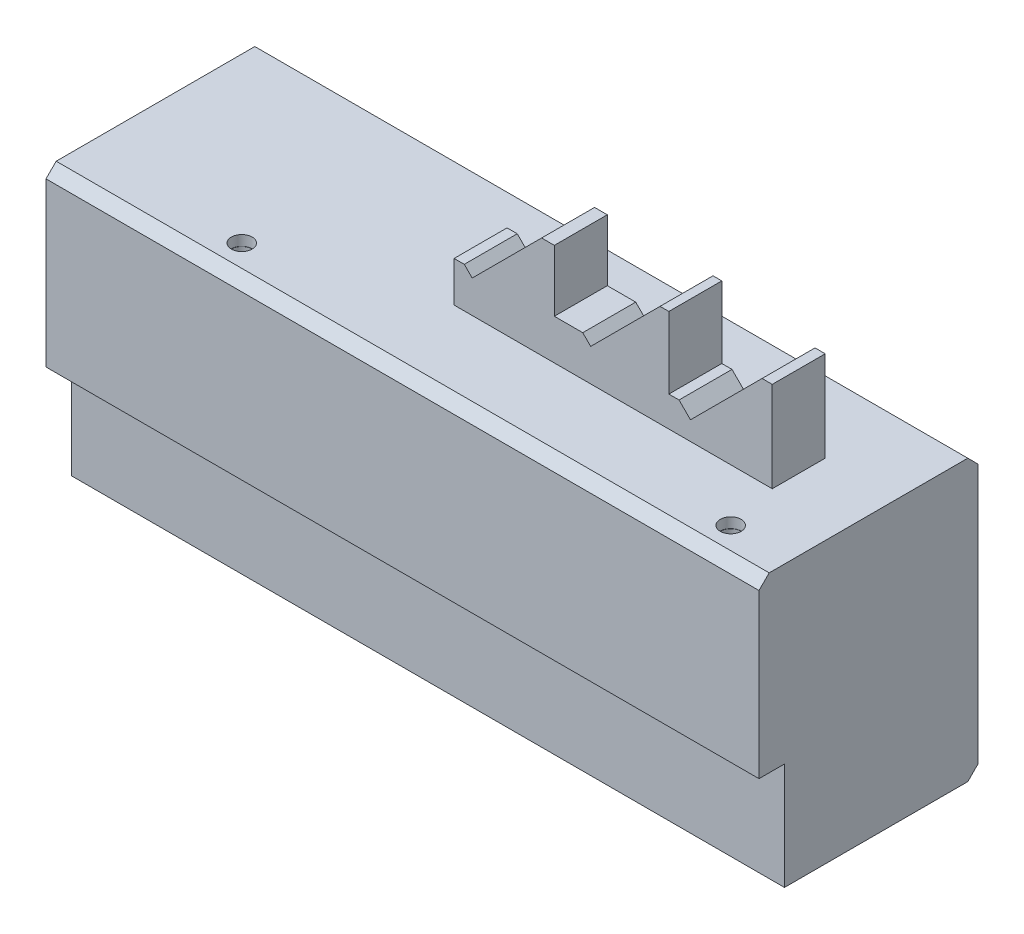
ISO-10303-21;
HEADER;
FILE_DESCRIPTION(('STEP AP214'),'2;1');
FILE_NAME('part.step','',(''),(''),'','','');
FILE_SCHEMA(('AUTOMOTIVE_DESIGN { 1 0 10303 214 1 1 1 1 }'));
ENDSEC;
DATA;
#1=APPLICATION_CONTEXT('core data for automotive mechanical design processes');
#2=APPLICATION_PROTOCOL_DEFINITION('international standard','automotive_design',2000,#1);
#3=PRODUCT_CONTEXT('',#1,'mechanical');
#4=PRODUCT('Part','Part','',(#3));
#5=PRODUCT_RELATED_PRODUCT_CATEGORY('part','',(#4));
#6=PRODUCT_DEFINITION_FORMATION('','',#4);
#7=PRODUCT_DEFINITION_CONTEXT('part definition',#1,'design');
#8=PRODUCT_DEFINITION('design','',#6,#7);
#9=PRODUCT_DEFINITION_SHAPE('','',#8);
#10=(LENGTH_UNIT() NAMED_UNIT(*) SI_UNIT(.MILLI.,.METRE.));
#11=(NAMED_UNIT(*) PLANE_ANGLE_UNIT() SI_UNIT($,.RADIAN.));
#12=(NAMED_UNIT(*) SI_UNIT($,.STERADIAN.) SOLID_ANGLE_UNIT());
#13=UNCERTAINTY_MEASURE_WITH_UNIT(LENGTH_MEASURE(1.E-05),#10,'distance_accuracy_value','');
#14=(GEOMETRIC_REPRESENTATION_CONTEXT(3) GLOBAL_UNCERTAINTY_ASSIGNED_CONTEXT((#13)) GLOBAL_UNIT_ASSIGNED_CONTEXT((#10,
#11,#12)) REPRESENTATION_CONTEXT('',''));
#15=CARTESIAN_POINT('',(0.,0.,0.));
#16=DIRECTION('',(0.,0.,1.));
#17=DIRECTION('',(1.,0.,0.));
#18=AXIS2_PLACEMENT_3D('',#15,#16,#17);
#19=CARTESIAN_POINT('',(0.,12.5,0.));
#20=DIRECTION('',(0.,1.,0.));
#21=DIRECTION('',(0.,0.,1.));
#22=AXIS2_PLACEMENT_3D('',#19,#20,#21);
#23=PLANE('',#22);
#24=DIRECTION('',(1.,0.,0.));
#25=VECTOR('',#24,1.);
#26=CARTESIAN_POINT('',(16.9834016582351,12.5,-2.75));
#27=LINE('',#26,#25);
#28=CARTESIAN_POINT('',(16.9834016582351,12.5,-2.75));
#29=VERTEX_POINT('',#28);
#30=CARTESIAN_POINT('',(17.8484689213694,12.5,-2.75));
#31=VERTEX_POINT('',#30);
#32=EDGE_CURVE('E743',#29,#31,#27,.T.);
#33=ORIENTED_EDGE('',*,*,#32,.F.);
#34=DIRECTION('',(0.,0.,-1.));
#35=VECTOR('',#34,1.);
#36=CARTESIAN_POINT('',(16.9834016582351,12.5,0.));
#37=LINE('',#36,#35);
#38=CARTESIAN_POINT('',(16.9834016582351,12.5,2.45));
#39=VERTEX_POINT('',#38);
#40=EDGE_CURVE('E634',#39,#29,#37,.T.);
#41=ORIENTED_EDGE('',*,*,#40,.F.);
#42=DIRECTION('',(-1.,0.,0.));
#43=VECTOR('',#42,1.);
#44=CARTESIAN_POINT('',(17.8484689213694,12.5,2.45));
#45=LINE('',#44,#43);
#46=CARTESIAN_POINT('',(17.8484689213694,12.5,2.45));
#47=VERTEX_POINT('',#46);
#48=EDGE_CURVE('E801',#47,#39,#45,.T.);
#49=ORIENTED_EDGE('',*,*,#48,.F.);
#50=DIRECTION('',(0.,0.,1.));
#51=VECTOR('',#50,1.);
#52=CARTESIAN_POINT('',(17.8484689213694,12.5,0.));
#53=LINE('',#52,#51);
#54=EDGE_CURVE('E628',#31,#47,#53,.T.);
#55=ORIENTED_EDGE('',*,*,#54,.F.);
#56=EDGE_LOOP('',(#33,#41,#49,#55));
#57=FACE_BOUND('',#56,.T.);
#58=ADVANCED_FACE('F42',(#57),#23,.T.);
#59=CARTESIAN_POINT('',(28.,12.5,-5.75));
#60=DIRECTION('',(-1.,0.,0.));
#61=DIRECTION('',(0.,0.,1.));
#62=AXIS2_PLACEMENT_3D('',#59,#60,#61);
#63=PLANE('',#62);
#64=DIRECTION('',(0.,0.,-1.));
#65=VECTOR('',#64,1.);
#66=CARTESIAN_POINT('',(28.,2.5,-5.75));
#67=LINE('',#66,#65);
#68=CARTESIAN_POINT('',(28.,2.5,2.45));
#69=VERTEX_POINT('',#68);
#70=CARTESIAN_POINT('',(28.,2.5,-2.75));
#71=VERTEX_POINT('',#70);
#72=EDGE_CURVE('E835',#69,#71,#67,.T.);
#73=ORIENTED_EDGE('',*,*,#72,.T.);
#74=DIRECTION('',(0.,-1.,0.));
#75=VECTOR('',#74,1.);
#76=CARTESIAN_POINT('',(28.,11.3772332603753,-2.75));
#77=LINE('',#76,#75);
#78=CARTESIAN_POINT('',(28.,11.3772332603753,-2.75));
#79=VERTEX_POINT('',#78);
#80=EDGE_CURVE('E711',#79,#71,#77,.T.);
#81=ORIENTED_EDGE('',*,*,#80,.F.);
#82=DIRECTION('',(0.,0.,-1.));
#83=VECTOR('',#82,1.);
#84=CARTESIAN_POINT('',(28.,11.3772332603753,10.75));
#85=LINE('',#84,#83);
#86=CARTESIAN_POINT('',(28.,11.3772332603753,2.45));
#87=VERTEX_POINT('',#86);
#88=EDGE_CURVE('E752',#87,#79,#85,.T.);
#89=ORIENTED_EDGE('',*,*,#88,.F.);
#90=DIRECTION('',(0.,1.,0.));
#91=VECTOR('',#90,1.);
#92=CARTESIAN_POINT('',(28.,2.5,2.45));
#93=LINE('',#92,#91);
#94=EDGE_CURVE('E784',#69,#87,#93,.T.);
#95=ORIENTED_EDGE('',*,*,#94,.F.);
#96=EDGE_LOOP('',(#73,#81,#89,#95));
#97=FACE_BOUND('',#96,.T.);
#98=ADVANCED_FACE('F449',(#97),#63,.F.);
#99=DIRECTION('',(1.,0.,0.));
#100=VECTOR('',#99,1.);
#101=CARTESIAN_POINT('',(5.35600165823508,12.5,-2.75));
#102=LINE('',#101,#100);
#103=CARTESIAN_POINT('',(5.35600165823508,12.5,-2.75));
#104=VERTEX_POINT('',#103);
#105=CARTESIAN_POINT('',(6.60712605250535,12.5,-2.75));
#106=VERTEX_POINT('',#105);
#107=EDGE_CURVE('E728',#104,#106,#102,.T.);
#108=ORIENTED_EDGE('',*,*,#107,.F.);
#109=DIRECTION('',(0.,0.,-1.));
#110=VECTOR('',#109,1.);
#111=CARTESIAN_POINT('',(5.35600165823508,12.5,0.));
#112=LINE('',#111,#110);
#113=CARTESIAN_POINT('',(5.35600165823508,12.5,2.45));
#114=VERTEX_POINT('',#113);
#115=EDGE_CURVE('E613',#114,#104,#112,.T.);
#116=ORIENTED_EDGE('',*,*,#115,.F.);
#117=DIRECTION('',(-1.,0.,0.));
#118=VECTOR('',#117,1.);
#119=CARTESIAN_POINT('',(6.60712605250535,12.5,2.45));
#120=LINE('',#119,#118);
#121=CARTESIAN_POINT('',(6.60712605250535,12.5,2.45));
#122=VERTEX_POINT('',#121);
#123=EDGE_CURVE('E768',#122,#114,#120,.T.);
#124=ORIENTED_EDGE('',*,*,#123,.F.);
#125=DIRECTION('',(0.,0.,1.));
#126=VECTOR('',#125,1.);
#127=CARTESIAN_POINT('',(6.60712605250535,12.5,0.));
#128=LINE('',#127,#126);
#129=EDGE_CURVE('E631',#106,#122,#128,.T.);
#130=ORIENTED_EDGE('',*,*,#129,.F.);
#131=EDGE_LOOP('',(#108,#116,#124,#130));
#132=FACE_BOUND('',#131,.T.);
#133=ADVANCED_FACE('F445',(#132),#23,.T.);
#134=CARTESIAN_POINT('',(-1.45734970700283,5.68664863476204,10.75));
#135=DIRECTION('',(-0.707106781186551,-0.707106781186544,0.));
#136=DIRECTION('',(0.707106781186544,-0.707106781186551,0.));
#137=AXIS2_PLACEMENT_3D('',#134,#135,#136);
#138=PLANE('',#137);
#139=DIRECTION('',(0.,0.,-1.));
#140=VECTOR('',#139,1.);
#141=CARTESIAN_POINT('',(-1.45734970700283,5.68664863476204,10.75));
#142=LINE('',#141,#140);
#143=CARTESIAN_POINT('',(-1.45734970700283,5.68664863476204,2.45));
#144=VERTEX_POINT('',#143);
#145=CARTESIAN_POINT('',(-1.45734970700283,5.68664863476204,-2.75));
#146=VERTEX_POINT('',#145);
#147=EDGE_CURVE('E831',#144,#146,#142,.T.);
#148=ORIENTED_EDGE('',*,*,#147,.T.);
#149=DIRECTION('',(0.707106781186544,-0.707106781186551,0.));
#150=VECTOR('',#149,1.);
#151=CARTESIAN_POINT('',(-2.23516716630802,6.46446609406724,-2.75));
#152=LINE('',#151,#150);
#153=CARTESIAN_POINT('',(-2.23516716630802,6.46446609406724,-2.75));
#154=VERTEX_POINT('',#153);
#155=EDGE_CURVE('E722',#154,#146,#152,.T.);
#156=ORIENTED_EDGE('',*,*,#155,.F.);
#157=DIRECTION('',(0.,0.,-1.));
#158=VECTOR('',#157,1.);
#159=CARTESIAN_POINT('',(-2.23516716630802,6.46446609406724,10.75));
#160=LINE('',#159,#158);
#161=CARTESIAN_POINT('',(-2.23516716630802,6.46446609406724,2.45));
#162=VERTEX_POINT('',#161);
#163=EDGE_CURVE('E811',#162,#154,#160,.T.);
#164=ORIENTED_EDGE('',*,*,#163,.F.);
#165=DIRECTION('',(-0.707106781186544,0.707106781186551,0.));
#166=VECTOR('',#165,1.);
#167=CARTESIAN_POINT('',(-1.45734970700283,5.68664863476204,2.45));
#168=LINE('',#167,#166);
#169=EDGE_CURVE('E774',#144,#162,#168,.T.);
#170=ORIENTED_EDGE('',*,*,#169,.F.);
#171=EDGE_LOOP('',(#148,#156,#164,#170));
#172=FACE_BOUND('',#171,.T.);
#173=ADVANCED_FACE('F441',(#172),#138,.F.);
#174=CARTESIAN_POINT('',(-2.23516716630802,6.46446609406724,10.75));
#175=DIRECTION('',(0.,-1.,0.));
#176=DIRECTION('',(0.,0.,-1.));
#177=AXIS2_PLACEMENT_3D('',#174,#175,#176);
#178=PLANE('',#177);
#179=DIRECTION('',(1.,0.,0.));
#180=VECTOR('',#179,1.);
#181=CARTESIAN_POINT('',(-5.,6.46446609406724,-2.75));
#182=LINE('',#181,#180);
#183=CARTESIAN_POINT('',(-3.23516716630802,6.46446609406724,-2.75));
#184=VERTEX_POINT('',#183);
#185=EDGE_CURVE('E719',#184,#154,#182,.T.);
#186=ORIENTED_EDGE('',*,*,#185,.F.);
#187=DIRECTION('',(0.,0.,-1.));
#188=VECTOR('',#187,1.);
#189=CARTESIAN_POINT('',(-3.23516716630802,6.46446609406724,-2.75));
#190=LINE('',#189,#188);
#191=CARTESIAN_POINT('',(-3.23516716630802,6.46446609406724,2.45));
#192=VERTEX_POINT('',#191);
#193=EDGE_CURVE('E688',#192,#184,#190,.T.);
#194=ORIENTED_EDGE('',*,*,#193,.F.);
#195=DIRECTION('',(-1.,0.,0.));
#196=VECTOR('',#195,1.);
#197=CARTESIAN_POINT('',(-2.23516716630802,6.46446609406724,2.45));
#198=LINE('',#197,#196);
#199=EDGE_CURVE('E777',#162,#192,#198,.T.);
#200=ORIENTED_EDGE('',*,*,#199,.F.);
#201=ORIENTED_EDGE('',*,*,#163,.T.);
#202=EDGE_LOOP('',(#186,#194,#200,#201));
#203=FACE_BOUND('',#202,.T.);
#204=ADVANCED_FACE('F437',(#203),#178,.F.);
#205=CARTESIAN_POINT('',(5.35600165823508,12.5,10.75));
#206=DIRECTION('',(0.70710678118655,-0.707106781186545,0.));
#207=DIRECTION('',(0.707106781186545,0.70710678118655,0.));
#208=AXIS2_PLACEMENT_3D('',#205,#206,#207);
#209=PLANE('',#208);
#210=DIRECTION('',(-0.707106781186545,-0.70710678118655,0.));
#211=VECTOR('',#210,1.);
#212=CARTESIAN_POINT('',(5.35600165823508,12.5,1.65));
#213=LINE('',#212,#211);
#214=CARTESIAN_POINT('',(3.44932597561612,10.593324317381,1.65));
#215=VERTEX_POINT('',#214);
#216=CARTESIAN_POINT('',(0.449325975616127,7.59332431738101,1.65));
#217=VERTEX_POINT('',#216);
#218=EDGE_CURVE('E674',#215,#217,#213,.T.);
#219=ORIENTED_EDGE('',*,*,#218,.T.);
#220=CARTESIAN_POINT('',(0.449325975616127,7.59332431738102,0.649999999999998));
#221=DIRECTION('',(0.70710678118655,-0.707106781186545,0.));
#222=DIRECTION('',(0.707106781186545,0.70710678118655,0.));
#223=AXIS2_PLACEMENT_3D('',#220,#221,#222);
#224=ELLIPSE('',#223,1.4142135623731,1.);
#225=CARTESIAN_POINT('',(0.449325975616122,7.593324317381,-0.350000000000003));
#226=VERTEX_POINT('',#225);
#227=EDGE_CURVE('E658',#217,#226,#224,.T.);
#228=ORIENTED_EDGE('',*,*,#227,.T.);
#229=DIRECTION('',(0.707106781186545,0.70710678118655,0.));
#230=VECTOR('',#229,1.);
#231=CARTESIAN_POINT('',(5.35600165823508,12.5,-0.350000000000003));
#232=LINE('',#231,#230);
#233=CARTESIAN_POINT('',(3.44932597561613,10.593324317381,-0.350000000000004));
#234=VERTEX_POINT('',#233);
#235=EDGE_CURVE('E682',#226,#234,#232,.T.);
#236=ORIENTED_EDGE('',*,*,#235,.T.);
#237=CARTESIAN_POINT('',(3.44932597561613,10.593324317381,0.649999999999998));
#238=DIRECTION('',(0.70710678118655,-0.707106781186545,0.));
#239=DIRECTION('',(0.707106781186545,0.70710678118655,0.));
#240=AXIS2_PLACEMENT_3D('',#237,#238,#239);
#241=ELLIPSE('',#240,1.4142135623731,1.);
#242=EDGE_CURVE('E677',#234,#215,#241,.T.);
#243=ORIENTED_EDGE('',*,*,#242,.T.);
#244=EDGE_LOOP('',(#219,#228,#236,#243));
#245=FACE_BOUND('',#244,.T.);
#246=ORIENTED_EDGE('',*,*,#115,.T.);
#247=DIRECTION('',(0.707106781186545,0.70710678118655,0.));
#248=VECTOR('',#247,1.);
#249=CARTESIAN_POINT('',(-1.45734970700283,5.68664863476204,-2.75));
#250=LINE('',#249,#248);
#251=EDGE_CURVE('E725',#146,#104,#250,.T.);
#252=ORIENTED_EDGE('',*,*,#251,.F.);
#253=ORIENTED_EDGE('',*,*,#147,.F.);
#254=DIRECTION('',(-0.707106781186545,-0.70710678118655,0.));
#255=VECTOR('',#254,1.);
#256=CARTESIAN_POINT('',(5.35600165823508,12.5,2.45));
#257=LINE('',#256,#255);
#258=EDGE_CURVE('E771',#114,#144,#257,.T.);
#259=ORIENTED_EDGE('',*,*,#258,.F.);
#260=EDGE_LOOP('',(#246,#252,#253,#259));
#261=FACE_BOUND('',#260,.T.);
#262=ADVANCED_FACE('F427',(#245,#261),#209,.F.);
#263=CARTESIAN_POINT('',(18.8484689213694,5.47323000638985,10.75));
#264=DIRECTION('',(0.,-1.,0.));
#265=DIRECTION('',(1.,0.,0.));
#266=AXIS2_PLACEMENT_3D('',#263,#264,#265);
#267=PLANE('',#266);
#268=DIRECTION('',(0.,0.,-1.));
#269=VECTOR('',#268,1.);
#270=CARTESIAN_POINT('',(18.8484689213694,5.47323000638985,10.75));
#271=LINE('',#270,#269);
#272=CARTESIAN_POINT('',(18.8484689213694,5.47323000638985,2.45));
#273=VERTEX_POINT('',#272);
#274=CARTESIAN_POINT('',(18.8484689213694,5.47323000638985,-2.75));
#275=VERTEX_POINT('',#274);
#276=EDGE_CURVE('E824',#273,#275,#271,.T.);
#277=ORIENTED_EDGE('',*,*,#276,.T.);
#278=DIRECTION('',(1.,0.,0.));
#279=VECTOR('',#278,1.);
#280=CARTESIAN_POINT('',(17.8484689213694,5.47323000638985,-2.75));
#281=LINE('',#280,#279);
#282=CARTESIAN_POINT('',(17.8484689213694,5.47323000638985,-2.75));
#283=VERTEX_POINT('',#282);
#284=EDGE_CURVE('E749',#283,#275,#281,.T.);
#285=ORIENTED_EDGE('',*,*,#284,.F.);
#286=DIRECTION('',(0.,0.,-1.));
#287=VECTOR('',#286,1.);
#288=CARTESIAN_POINT('',(17.8484689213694,5.47323000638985,10.75));
#289=LINE('',#288,#287);
#290=CARTESIAN_POINT('',(17.8484689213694,5.47323000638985,2.45));
#291=VERTEX_POINT('',#290);
#292=EDGE_CURVE('E820',#291,#283,#289,.T.);
#293=ORIENTED_EDGE('',*,*,#292,.F.);
#294=DIRECTION('',(-1.,0.,0.));
#295=VECTOR('',#294,1.);
#296=CARTESIAN_POINT('',(18.8484689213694,5.47323000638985,2.45));
#297=LINE('',#296,#295);
#298=EDGE_CURVE('E794',#273,#291,#297,.T.);
#299=ORIENTED_EDGE('',*,*,#298,.F.);
#300=EDGE_LOOP('',(#277,#285,#293,#299));
#301=FACE_BOUND('',#300,.T.);
#302=ADVANCED_FACE('F423',(#301),#267,.F.);
#303=CARTESIAN_POINT('',(19.9722328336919,4.34946609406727,10.75));
#304=DIRECTION('',(-0.707106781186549,-0.707106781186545,0.));
#305=DIRECTION('',(0.707106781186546,-0.707106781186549,0.));
#306=AXIS2_PLACEMENT_3D('',#303,#304,#305);
#307=PLANE('',#306);
#308=DIRECTION('',(0.,0.,-1.));
#309=VECTOR('',#308,1.);
#310=CARTESIAN_POINT('',(19.9722328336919,4.34946609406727,10.75));
#311=LINE('',#310,#309);
#312=CARTESIAN_POINT('',(19.9722328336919,4.34946609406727,2.45));
#313=VERTEX_POINT('',#312);
#314=CARTESIAN_POINT('',(19.9722328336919,4.34946609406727,-2.75));
#315=VERTEX_POINT('',#314);
#316=EDGE_CURVE('E806',#313,#315,#311,.T.);
#317=ORIENTED_EDGE('',*,*,#316,.T.);
#318=DIRECTION('',(0.707106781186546,-0.70710678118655,0.));
#319=VECTOR('',#318,1.);
#320=CARTESIAN_POINT('',(18.8484689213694,5.47323000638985,-2.75));
#321=LINE('',#320,#319);
#322=EDGE_CURVE('E700',#275,#315,#321,.T.);
#323=ORIENTED_EDGE('',*,*,#322,.F.);
#324=ORIENTED_EDGE('',*,*,#276,.F.);
#325=DIRECTION('',(-0.707106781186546,0.70710678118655,0.));
#326=VECTOR('',#325,1.);
#327=CARTESIAN_POINT('',(19.9722328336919,4.34946609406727,2.45));
#328=LINE('',#327,#326);
#329=EDGE_CURVE('E791',#313,#273,#328,.T.);
#330=ORIENTED_EDGE('',*,*,#329,.F.);
#331=EDGE_LOOP('',(#317,#323,#324,#330));
#332=FACE_BOUND('',#331,.T.);
#333=ADVANCED_FACE('F426',(#332),#307,.F.);
#334=CARTESIAN_POINT('',(28.1227667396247,12.5,10.75));
#335=DIRECTION('',(0.707106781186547,-0.707106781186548,0.));
#336=DIRECTION('',(0.707106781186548,0.707106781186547,0.));
#337=AXIS2_PLACEMENT_3D('',#334,#335,#336);
#338=PLANE('',#337);
#339=DIRECTION('',(-0.707106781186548,-0.707106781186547,0.));
#340=VECTOR('',#339,1.);
#341=CARTESIAN_POINT('',(28.1227667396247,12.5,1.65));
#342=LINE('',#341,#340);
#343=CARTESIAN_POINT('',(25.0793259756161,9.45655923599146,1.65));
#344=VERTEX_POINT('',#343);
#345=CARTESIAN_POINT('',(22.0793259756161,6.45655923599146,1.65));
#346=VERTEX_POINT('',#345);
#347=EDGE_CURVE('E1503',#344,#346,#342,.T.);
#348=ORIENTED_EDGE('',*,*,#347,.T.);
#349=CARTESIAN_POINT('',(22.0793259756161,6.45655923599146,0.649999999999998));
#350=DIRECTION('',(0.707106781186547,-0.707106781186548,0.));
#351=DIRECTION('',(0.707106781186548,0.707106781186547,0.));
#352=AXIS2_PLACEMENT_3D('',#349,#350,#351);
#353=ELLIPSE('',#352,1.4142135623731,1.);
#354=CARTESIAN_POINT('',(22.0793259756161,6.45655923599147,-0.350000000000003));
#355=VERTEX_POINT('',#354);
#356=EDGE_CURVE('E317',#346,#355,#353,.T.);
#357=ORIENTED_EDGE('',*,*,#356,.T.);
#358=DIRECTION('',(0.707106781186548,0.707106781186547,0.));
#359=VECTOR('',#358,1.);
#360=CARTESIAN_POINT('',(28.1227667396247,12.5,-0.350000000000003));
#361=LINE('',#360,#359);
#362=CARTESIAN_POINT('',(25.0793259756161,9.45655923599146,-0.350000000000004));
#363=VERTEX_POINT('',#362);
#364=EDGE_CURVE('E1509',#355,#363,#361,.T.);
#365=ORIENTED_EDGE('',*,*,#364,.T.);
#366=CARTESIAN_POINT('',(25.0793259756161,9.45655923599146,0.649999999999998));
#367=DIRECTION('',(0.707106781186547,-0.707106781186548,0.));
#368=DIRECTION('',(0.707106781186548,0.707106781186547,0.));
#369=AXIS2_PLACEMENT_3D('',#366,#367,#368);
#370=ELLIPSE('',#369,1.4142135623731,1.);
#371=EDGE_CURVE('E1492',#363,#344,#370,.T.);
#372=ORIENTED_EDGE('',*,*,#371,.T.);
#373=EDGE_LOOP('',(#348,#357,#365,#372));
#374=FACE_BOUND('',#373,.T.);
#375=DIRECTION('',(0.,0.,-1.));
#376=VECTOR('',#375,1.);
#377=CARTESIAN_POINT('',(27.,11.3772332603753,10.75));
#378=LINE('',#377,#376);
#379=CARTESIAN_POINT('',(27.,11.3772332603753,2.45));
#380=VERTEX_POINT('',#379);
#381=CARTESIAN_POINT('',(27.,11.3772332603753,-2.75));
#382=VERTEX_POINT('',#381);
#383=EDGE_CURVE('E753',#380,#382,#378,.T.);
#384=ORIENTED_EDGE('',*,*,#383,.T.);
#385=DIRECTION('',(0.707106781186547,0.707106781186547,0.));
#386=VECTOR('',#385,1.);
#387=CARTESIAN_POINT('',(19.9722328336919,4.34946609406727,-2.75));
#388=LINE('',#387,#386);
#389=EDGE_CURVE('E705',#315,#382,#388,.T.);
#390=ORIENTED_EDGE('',*,*,#389,.F.);
#391=ORIENTED_EDGE('',*,*,#316,.F.);
#392=DIRECTION('',(-0.707106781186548,-0.707106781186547,0.));
#393=VECTOR('',#392,1.);
#394=CARTESIAN_POINT('',(28.,12.3772332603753,2.45));
#395=LINE('',#394,#393);
#396=EDGE_CURVE('E788',#380,#313,#395,.T.);
#397=ORIENTED_EDGE('',*,*,#396,.F.);
#398=EDGE_LOOP('',(#384,#390,#391,#397));
#399=FACE_BOUND('',#398,.T.);
#400=ADVANCED_FACE('F421',(#374,#399),#338,.F.);
#401=CARTESIAN_POINT('',(17.8484689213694,5.47323000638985,10.75));
#402=DIRECTION('',(-1.,0.,0.));
#403=DIRECTION('',(0.,0.,1.));
#404=AXIS2_PLACEMENT_3D('',#401,#402,#403);
#405=PLANE('',#404);
#406=ORIENTED_EDGE('',*,*,#292,.T.);
#407=DIRECTION('',(0.,-1.,0.));
#408=VECTOR('',#407,1.);
#409=CARTESIAN_POINT('',(17.8484689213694,12.5,-2.75));
#410=LINE('',#409,#408);
#411=EDGE_CURVE('E746',#31,#283,#410,.T.);
#412=ORIENTED_EDGE('',*,*,#411,.F.);
#413=ORIENTED_EDGE('',*,*,#54,.T.);
#414=DIRECTION('',(0.,1.,0.));
#415=VECTOR('',#414,1.);
#416=CARTESIAN_POINT('',(17.8484689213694,5.47323000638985,2.45));
#417=LINE('',#416,#415);
#418=EDGE_CURVE('E797',#291,#47,#417,.T.);
#419=ORIENTED_EDGE('',*,*,#418,.F.);
#420=EDGE_LOOP('',(#406,#412,#413,#419));
#421=FACE_BOUND('',#420,.T.);
#422=ADVANCED_FACE('F417',(#421),#405,.F.);
#423=CARTESIAN_POINT('',(9.39623283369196,6.46846609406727,10.75));
#424=DIRECTION('',(0.,-1.,0.));
#425=DIRECTION('',(0.,0.,-1.));
#426=AXIS2_PLACEMENT_3D('',#423,#424,#425);
#427=PLANE('',#426);
#428=DIRECTION('',(0.,0.,-1.));
#429=VECTOR('',#428,1.);
#430=CARTESIAN_POINT('',(9.39623283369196,6.46846609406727,10.75));
#431=LINE('',#430,#429);
#432=CARTESIAN_POINT('',(9.39623283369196,6.46846609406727,2.45));
#433=VERTEX_POINT('',#432);
#434=CARTESIAN_POINT('',(9.39623283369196,6.46846609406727,-2.75));
#435=VERTEX_POINT('',#434);
#436=EDGE_CURVE('E807',#433,#435,#431,.T.);
#437=ORIENTED_EDGE('',*,*,#436,.T.);
#438=DIRECTION('',(1.,0.,0.));
#439=VECTOR('',#438,1.);
#440=CARTESIAN_POINT('',(6.60712605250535,6.46846609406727,-2.75));
#441=LINE('',#440,#439);
#442=CARTESIAN_POINT('',(6.60712605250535,6.46846609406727,-2.75));
#443=VERTEX_POINT('',#442);
#444=EDGE_CURVE('E734',#443,#435,#441,.T.);
#445=ORIENTED_EDGE('',*,*,#444,.F.);
#446=DIRECTION('',(0.,0.,-1.));
#447=VECTOR('',#446,1.);
#448=CARTESIAN_POINT('',(6.60712605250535,6.46846609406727,10.75));
#449=LINE('',#448,#447);
#450=CARTESIAN_POINT('',(6.60712605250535,6.46846609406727,2.45));
#451=VERTEX_POINT('',#450);
#452=EDGE_CURVE('E816',#451,#443,#449,.T.);
#453=ORIENTED_EDGE('',*,*,#452,.F.);
#454=DIRECTION('',(-1.,0.,0.));
#455=VECTOR('',#454,1.);
#456=CARTESIAN_POINT('',(9.39623283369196,6.46846609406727,2.45));
#457=LINE('',#456,#455);
#458=EDGE_CURVE('E761',#433,#451,#457,.T.);
#459=ORIENTED_EDGE('',*,*,#458,.F.);
#460=EDGE_LOOP('',(#437,#445,#453,#459));
#461=FACE_BOUND('',#460,.T.);
#462=ADVANCED_FACE('F405',(#461),#427,.F.);
#463=CARTESIAN_POINT('',(10.1740502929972,5.69064863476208,10.75));
#464=DIRECTION('',(-0.707106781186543,-0.707106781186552,0.));
#465=DIRECTION('',(0.707106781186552,-0.707106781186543,0.));
#466=AXIS2_PLACEMENT_3D('',#463,#464,#465);
#467=PLANE('',#466);
#468=DIRECTION('',(0.,0.,-1.));
#469=VECTOR('',#468,1.);
#470=CARTESIAN_POINT('',(10.1740502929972,5.69064863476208,10.75));
#471=LINE('',#470,#469);
#472=CARTESIAN_POINT('',(10.1740502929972,5.69064863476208,2.45));
#473=VERTEX_POINT('',#472);
#474=CARTESIAN_POINT('',(10.1740502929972,5.69064863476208,-2.75));
#475=VERTEX_POINT('',#474);
#476=EDGE_CURVE('E812',#473,#475,#471,.T.);
#477=ORIENTED_EDGE('',*,*,#476,.T.);
#478=DIRECTION('',(0.707106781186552,-0.707106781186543,0.));
#479=VECTOR('',#478,1.);
#480=CARTESIAN_POINT('',(9.39623283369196,6.46846609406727,-2.75));
#481=LINE('',#480,#479);
#482=EDGE_CURVE('E737',#435,#475,#481,.T.);
#483=ORIENTED_EDGE('',*,*,#482,.F.);
#484=ORIENTED_EDGE('',*,*,#436,.F.);
#485=DIRECTION('',(-0.707106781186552,0.707106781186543,0.));
#486=VECTOR('',#485,1.);
#487=CARTESIAN_POINT('',(10.1740502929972,5.69064863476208,2.45));
#488=LINE('',#487,#486);
#489=EDGE_CURVE('E757',#473,#433,#488,.T.);
#490=ORIENTED_EDGE('',*,*,#489,.F.);
#491=EDGE_LOOP('',(#477,#483,#484,#490));
#492=FACE_BOUND('',#491,.T.);
#493=ADVANCED_FACE('F401',(#492),#467,.F.);
#494=CARTESIAN_POINT('',(16.9834016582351,12.5,10.75));
#495=DIRECTION('',(0.707106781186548,-0.707106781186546,0.));
#496=DIRECTION('',(0.707106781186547,0.707106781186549,0.));
#497=AXIS2_PLACEMENT_3D('',#494,#495,#496);
#498=PLANE('',#497);
#499=DIRECTION('',(-0.707106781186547,-0.707106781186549,0.));
#500=VECTOR('',#499,1.);
#501=CARTESIAN_POINT('',(16.9834016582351,12.5,1.65));
#502=LINE('',#501,#500);
#503=CARTESIAN_POINT('',(15.0793259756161,10.595924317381,1.65));
#504=VERTEX_POINT('',#503);
#505=CARTESIAN_POINT('',(12.0793259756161,7.59592431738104,1.65));
#506=VERTEX_POINT('',#505);
#507=EDGE_CURVE('E1514',#504,#506,#502,.T.);
#508=ORIENTED_EDGE('',*,*,#507,.T.);
#509=CARTESIAN_POINT('',(12.0793259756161,7.59592431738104,0.649999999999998));
#510=DIRECTION('',(0.707106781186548,-0.707106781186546,0.));
#511=DIRECTION('',(0.707106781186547,0.707106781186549,0.));
#512=AXIS2_PLACEMENT_3D('',#509,#510,#511);
#513=ELLIPSE('',#512,1.4142135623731,1.);
#514=CARTESIAN_POINT('',(12.0793259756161,7.59592431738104,-0.350000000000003));
#515=VERTEX_POINT('',#514);
#516=EDGE_CURVE('E661',#506,#515,#513,.T.);
#517=ORIENTED_EDGE('',*,*,#516,.T.);
#518=DIRECTION('',(0.707106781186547,0.707106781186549,0.));
#519=VECTOR('',#518,1.);
#520=CARTESIAN_POINT('',(16.9834016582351,12.5,-0.350000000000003));
#521=LINE('',#520,#519);
#522=CARTESIAN_POINT('',(15.0793259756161,10.595924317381,-0.350000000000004));
#523=VERTEX_POINT('',#522);
#524=EDGE_CURVE('E670',#515,#523,#521,.T.);
#525=ORIENTED_EDGE('',*,*,#524,.T.);
#526=CARTESIAN_POINT('',(15.0793259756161,10.595924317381,0.649999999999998));
#527=DIRECTION('',(0.707106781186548,-0.707106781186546,0.));
#528=DIRECTION('',(0.707106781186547,0.707106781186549,0.));
#529=AXIS2_PLACEMENT_3D('',#526,#527,#528);
#530=ELLIPSE('',#529,1.4142135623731,1.);
#531=EDGE_CURVE('E1518',#523,#504,#530,.T.);
#532=ORIENTED_EDGE('',*,*,#531,.T.);
#533=EDGE_LOOP('',(#508,#517,#525,#532));
#534=FACE_BOUND('',#533,.T.);
#535=ORIENTED_EDGE('',*,*,#40,.T.);
#536=DIRECTION('',(0.707106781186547,0.707106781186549,0.));
#537=VECTOR('',#536,1.);
#538=CARTESIAN_POINT('',(10.1740502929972,5.69064863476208,-2.75));
#539=LINE('',#538,#537);
#540=EDGE_CURVE('E740',#475,#29,#539,.T.);
#541=ORIENTED_EDGE('',*,*,#540,.F.);
#542=ORIENTED_EDGE('',*,*,#476,.F.);
#543=DIRECTION('',(-0.707106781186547,-0.707106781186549,0.));
#544=VECTOR('',#543,1.);
#545=CARTESIAN_POINT('',(16.9834016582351,12.5,2.45));
#546=LINE('',#545,#544);
#547=EDGE_CURVE('E803',#39,#473,#546,.T.);
#548=ORIENTED_EDGE('',*,*,#547,.F.);
#549=EDGE_LOOP('',(#535,#541,#542,#548));
#550=FACE_BOUND('',#549,.T.);
#551=ADVANCED_FACE('F404',(#534,#550),#498,.F.);
#552=CARTESIAN_POINT('',(6.60712605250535,6.46846609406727,10.75));
#553=DIRECTION('',(-1.,0.,0.));
#554=DIRECTION('',(0.,-1.,0.));
#555=AXIS2_PLACEMENT_3D('',#552,#553,#554);
#556=PLANE('',#555);
#557=ORIENTED_EDGE('',*,*,#452,.T.);
#558=DIRECTION('',(0.,-1.,0.));
#559=VECTOR('',#558,1.);
#560=CARTESIAN_POINT('',(6.60712605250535,12.5,-2.75));
#561=LINE('',#560,#559);
#562=EDGE_CURVE('E731',#106,#443,#561,.T.);
#563=ORIENTED_EDGE('',*,*,#562,.F.);
#564=ORIENTED_EDGE('',*,*,#129,.T.);
#565=DIRECTION('',(0.,1.,0.));
#566=VECTOR('',#565,1.);
#567=CARTESIAN_POINT('',(6.60712605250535,6.46846609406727,2.45));
#568=LINE('',#567,#566);
#569=EDGE_CURVE('E764',#451,#122,#568,.T.);
#570=ORIENTED_EDGE('',*,*,#569,.F.);
#571=EDGE_LOOP('',(#557,#563,#564,#570));
#572=FACE_BOUND('',#571,.T.);
#573=ADVANCED_FACE('F409',(#572),#556,.F.);
#574=CARTESIAN_POINT('',(0.,2.5,0.));
#575=DIRECTION('',(0.,-1.,0.));
#576=DIRECTION('',(0.,0.,-1.));
#577=AXIS2_PLACEMENT_3D('',#574,#575,#576);
#578=PLANE('',#577);
#579=DIRECTION('',(1.,0.,0.));
#580=VECTOR('',#579,1.);
#581=CARTESIAN_POINT('',(-5.,2.5,2.45));
#582=LINE('',#581,#580);
#583=CARTESIAN_POINT('',(-3.23516716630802,2.5,2.45));
#584=VERTEX_POINT('',#583);
#585=EDGE_CURVE('E781',#584,#69,#582,.T.);
#586=ORIENTED_EDGE('',*,*,#585,.F.);
#587=DIRECTION('',(0.,0.,-1.));
#588=VECTOR('',#587,1.);
#589=CARTESIAN_POINT('',(-3.23516716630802,2.5,-2.75));
#590=LINE('',#589,#588);
#591=CARTESIAN_POINT('',(-3.23516716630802,2.5,-2.75));
#592=VERTEX_POINT('',#591);
#593=EDGE_CURVE('E692',#584,#592,#590,.T.);
#594=ORIENTED_EDGE('',*,*,#593,.T.);
#595=DIRECTION('',(-1.,0.,0.));
#596=VECTOR('',#595,1.);
#597=CARTESIAN_POINT('',(28.,2.5,-2.75));
#598=LINE('',#597,#596);
#599=EDGE_CURVE('E715',#71,#592,#598,.T.);
#600=ORIENTED_EDGE('',*,*,#599,.F.);
#601=ORIENTED_EDGE('',*,*,#72,.F.);
#602=EDGE_LOOP('',(#586,#594,#600,#601));
#603=FACE_BOUND('',#602,.T.);
#604=DIRECTION('',(0.,0.,1.));
#605=VECTOR('',#604,1.);
#606=CARTESIAN_POINT('',(-35.,2.5,10.75));
#607=LINE('',#606,#605);
#608=CARTESIAN_POINT('',(-35.,2.5,-9.74999999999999));
#609=VERTEX_POINT('',#608);
#610=CARTESIAN_POINT('',(-35.,2.5,9.74999999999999));
#611=VERTEX_POINT('',#610);
#612=EDGE_CURVE('E554',#609,#611,#607,.T.);
#613=ORIENTED_EDGE('',*,*,#612,.T.);
#614=DIRECTION('',(1.,0.,0.));
#615=VECTOR('',#614,1.);
#616=CARTESIAN_POINT('',(0.,2.5,9.74999999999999));
#617=LINE('',#616,#615);
#618=CARTESIAN_POINT('',(35.,2.5,9.74999999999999));
#619=VERTEX_POINT('',#618);
#620=EDGE_CURVE('E609',#611,#619,#617,.T.);
#621=ORIENTED_EDGE('',*,*,#620,.T.);
#622=DIRECTION('',(0.,0.,-1.));
#623=VECTOR('',#622,1.);
#624=CARTESIAN_POINT('',(35.,2.5,10.75));
#625=LINE('',#624,#623);
#626=CARTESIAN_POINT('',(35.,2.5,-9.74999999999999));
#627=VERTEX_POINT('',#626);
#628=EDGE_CURVE('E550',#619,#627,#625,.T.);
#629=ORIENTED_EDGE('',*,*,#628,.T.);
#630=DIRECTION('',(-1.,0.,0.));
#631=VECTOR('',#630,1.);
#632=CARTESIAN_POINT('',(0.,2.5,-9.74999999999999));
#633=LINE('',#632,#631);
#634=EDGE_CURVE('E605',#627,#609,#633,.T.);
#635=ORIENTED_EDGE('',*,*,#634,.T.);
#636=EDGE_LOOP('',(#613,#621,#629,#635));
#637=FACE_BOUND('',#636,.T.);
#638=CARTESIAN_POINT('',(29.0703667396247,2.5,7.60000000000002));
#639=DIRECTION('',(0.,1.,0.));
#640=DIRECTION('',(0.,0.,1.));
#641=AXIS2_PLACEMENT_3D('',#638,#639,#640);
#642=CIRCLE('',#641,1.025);
#643=CARTESIAN_POINT('',(29.0703667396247,2.5,8.62500000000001));
#644=VERTEX_POINT('',#643);
#645=EDGE_CURVE('E850',#644,#644,#642,.T.);
#646=ORIENTED_EDGE('',*,*,#645,.F.);
#647=EDGE_LOOP('',(#646));
#648=FACE_BOUND('',#647,.T.);
#649=CARTESIAN_POINT('',(-18.9296332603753,2.5,7.60000000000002));
#650=DIRECTION('',(0.,1.,0.));
#651=DIRECTION('',(0.,0.,1.));
#652=AXIS2_PLACEMENT_3D('',#649,#650,#651);
#653=CIRCLE('',#652,1.025);
#654=CARTESIAN_POINT('',(-18.9296332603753,2.5,8.62500000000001));
#655=VERTEX_POINT('',#654);
#656=EDGE_CURVE('E618',#655,#655,#653,.T.);
#657=ORIENTED_EDGE('',*,*,#656,.F.);
#658=EDGE_LOOP('',(#657));
#659=FACE_BOUND('',#658,.T.);
#660=ADVANCED_FACE('F413',(#603,#637,#648,#659),#578,.F.);
#661=CARTESIAN_POINT('',(35.,2.5,10.75));
#662=DIRECTION('',(-1.,0.,0.));
#663=DIRECTION('',(0.,0.,1.));
#664=AXIS2_PLACEMENT_3D('',#661,#662,#663);
#665=PLANE('',#664);
#666=DIRECTION('',(0.,0.,-1.));
#667=VECTOR('',#666,1.);
#668=CARTESIAN_POINT('',(35.,-14.5,8.25));
#669=LINE('',#668,#667);
#670=CARTESIAN_POINT('',(35.,-14.5,10.75));
#671=VERTEX_POINT('',#670);
#672=CARTESIAN_POINT('',(35.,-14.5,8.25));
#673=VERTEX_POINT('',#672);
#674=EDGE_CURVE('E866',#671,#673,#669,.T.);
#675=ORIENTED_EDGE('',*,*,#674,.T.);
#676=DIRECTION('',(0.,-1.,0.));
#677=VECTOR('',#676,1.);
#678=CARTESIAN_POINT('',(35.,-25.,8.25));
#679=LINE('',#678,#677);
#680=CARTESIAN_POINT('',(35.,-25.,8.25));
#681=VERTEX_POINT('',#680);
#682=EDGE_CURVE('E862',#673,#681,#679,.T.);
#683=ORIENTED_EDGE('',*,*,#682,.T.);
#684=DIRECTION('',(0.,0.,1.));
#685=VECTOR('',#684,1.);
#686=CARTESIAN_POINT('',(35.,-25.,10.75));
#687=LINE('',#686,#685);
#688=CARTESIAN_POINT('',(35.,-25.,-9.74999999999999));
#689=VERTEX_POINT('',#688);
#690=EDGE_CURVE('E546',#689,#681,#687,.T.);
#691=ORIENTED_EDGE('',*,*,#690,.F.);
#692=DIRECTION('',(0.,0.707106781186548,-0.707106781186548));
#693=VECTOR('',#692,1.);
#694=CARTESIAN_POINT('',(35.,-25.,-9.74999999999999));
#695=LINE('',#694,#693);
#696=CARTESIAN_POINT('',(35.,-24.,-10.75));
#697=VERTEX_POINT('',#696);
#698=EDGE_CURVE('E596',#689,#697,#695,.T.);
#699=ORIENTED_EDGE('',*,*,#698,.T.);
#700=DIRECTION('',(0.,-1.,0.));
#701=VECTOR('',#700,1.);
#702=CARTESIAN_POINT('',(35.,2.5,-10.75));
#703=LINE('',#702,#701);
#704=CARTESIAN_POINT('',(35.,1.49999999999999,-10.75));
#705=VERTEX_POINT('',#704);
#706=EDGE_CURVE('E570',#705,#697,#703,.T.);
#707=ORIENTED_EDGE('',*,*,#706,.F.);
#708=DIRECTION('',(0.,-0.707106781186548,-0.707106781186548));
#709=VECTOR('',#708,1.);
#710=CARTESIAN_POINT('',(35.,2.5,-9.74999999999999));
#711=LINE('',#710,#709);
#712=EDGE_CURVE('E590',#705,#627,#711,.F.);
#713=ORIENTED_EDGE('',*,*,#712,.T.);
#714=ORIENTED_EDGE('',*,*,#628,.F.);
#715=DIRECTION('',(0.,0.707106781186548,-0.707106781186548));
#716=VECTOR('',#715,1.);
#717=CARTESIAN_POINT('',(35.,2.5,9.74999999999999));
#718=LINE('',#717,#716);
#719=CARTESIAN_POINT('',(35.,1.49999999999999,10.75));
#720=VERTEX_POINT('',#719);
#721=EDGE_CURVE('E593',#619,#720,#718,.F.);
#722=ORIENTED_EDGE('',*,*,#721,.T.);
#723=DIRECTION('',(0.,-1.,0.));
#724=VECTOR('',#723,1.);
#725=CARTESIAN_POINT('',(35.,2.5,10.75));
#726=LINE('',#725,#724);
#727=EDGE_CURVE('E558',#720,#671,#726,.T.);
#728=ORIENTED_EDGE('',*,*,#727,.T.);
#729=EDGE_LOOP('',(#675,#683,#691,#699,#707,#713,#714,#722,#728));
#730=FACE_BOUND('',#729,.T.);
#731=ADVANCED_FACE('F917',(#730),#665,.F.);
#732=CARTESIAN_POINT('',(-35.,2.5,-10.75));
#733=DIRECTION('',(0.,0.,1.));
#734=DIRECTION('',(1.,0.,0.));
#735=AXIS2_PLACEMENT_3D('',#732,#733,#734);
#736=PLANE('',#735);
#737=ORIENTED_EDGE('',*,*,#706,.T.);
#738=DIRECTION('',(-1.,0.,0.));
#739=VECTOR('',#738,1.);
#740=CARTESIAN_POINT('',(-35.,-24.,-10.75));
#741=LINE('',#740,#739);
#742=CARTESIAN_POINT('',(-35.,-24.,-10.75));
#743=VERTEX_POINT('',#742);
#744=EDGE_CURVE('E602',#697,#743,#741,.T.);
#745=ORIENTED_EDGE('',*,*,#744,.T.);
#746=DIRECTION('',(0.,-1.,0.));
#747=VECTOR('',#746,1.);
#748=CARTESIAN_POINT('',(-35.,2.5,-10.75));
#749=LINE('',#748,#747);
#750=CARTESIAN_POINT('',(-35.,1.49999999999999,-10.75));
#751=VERTEX_POINT('',#750);
#752=EDGE_CURVE('E566',#751,#743,#749,.T.);
#753=ORIENTED_EDGE('',*,*,#752,.F.);
#754=DIRECTION('',(1.,0.,0.));
#755=VECTOR('',#754,1.);
#756=CARTESIAN_POINT('',(-35.,1.49999999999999,-10.75));
#757=LINE('',#756,#755);
#758=EDGE_CURVE('E599',#751,#705,#757,.T.);
#759=ORIENTED_EDGE('',*,*,#758,.T.);
#760=EDGE_LOOP('',(#737,#745,#753,#759));
#761=FACE_BOUND('',#760,.T.);
#762=ADVANCED_FACE('F922',(#761),#736,.F.);
#763=CARTESIAN_POINT('',(-35.,2.5,10.75));
#764=DIRECTION('',(1.,0.,0.));
#765=DIRECTION('',(0.,0.,-1.));
#766=AXIS2_PLACEMENT_3D('',#763,#764,#765);
#767=PLANE('',#766);
#768=CARTESIAN_POINT('',(-35.,-11.25,0.));
#769=DIRECTION('',(-1.,0.,0.));
#770=DIRECTION('',(0.,0.,1.));
#771=AXIS2_PLACEMENT_3D('',#768,#769,#770);
#772=CIRCLE('',#771,4.4);
#773=CARTESIAN_POINT('',(-35.,-11.25,4.4));
#774=VERTEX_POINT('',#773);
#775=EDGE_CURVE('E526',#774,#774,#772,.T.);
#776=ORIENTED_EDGE('',*,*,#775,.F.);
#777=EDGE_LOOP('',(#776));
#778=FACE_BOUND('',#777,.T.);
#779=DIRECTION('',(0.,0.,-1.));
#780=VECTOR('',#779,1.);
#781=CARTESIAN_POINT('',(-35.,-25.,10.75));
#782=LINE('',#781,#780);
#783=CARTESIAN_POINT('',(-35.,-25.,8.25));
#784=VERTEX_POINT('',#783);
#785=CARTESIAN_POINT('',(-35.,-25.,-9.74999999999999));
#786=VERTEX_POINT('',#785);
#787=EDGE_CURVE('E543',#784,#786,#782,.T.);
#788=ORIENTED_EDGE('',*,*,#787,.F.);
#789=DIRECTION('',(0.,-1.,0.));
#790=VECTOR('',#789,1.);
#791=CARTESIAN_POINT('',(-35.,-25.,8.25));
#792=LINE('',#791,#790);
#793=CARTESIAN_POINT('',(-35.,-14.5,8.25));
#794=VERTEX_POINT('',#793);
#795=EDGE_CURVE('E858',#794,#784,#792,.T.);
#796=ORIENTED_EDGE('',*,*,#795,.F.);
#797=DIRECTION('',(0.,0.,-1.));
#798=VECTOR('',#797,1.);
#799=CARTESIAN_POINT('',(-35.,-14.5,8.25));
#800=LINE('',#799,#798);
#801=CARTESIAN_POINT('',(-35.,-14.5,10.75));
#802=VERTEX_POINT('',#801);
#803=EDGE_CURVE('E867',#802,#794,#800,.T.);
#804=ORIENTED_EDGE('',*,*,#803,.F.);
#805=DIRECTION('',(0.,-1.,0.));
#806=VECTOR('',#805,1.);
#807=CARTESIAN_POINT('',(-35.,2.5,10.75));
#808=LINE('',#807,#806);
#809=CARTESIAN_POINT('',(-35.,1.49999999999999,10.75));
#810=VERTEX_POINT('',#809);
#811=EDGE_CURVE('E562',#810,#802,#808,.T.);
#812=ORIENTED_EDGE('',*,*,#811,.F.);
#813=DIRECTION('',(0.,-0.707106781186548,0.707106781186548));
#814=VECTOR('',#813,1.);
#815=CARTESIAN_POINT('',(-35.,2.5,9.74999999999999));
#816=LINE('',#815,#814);
#817=EDGE_CURVE('E581',#810,#611,#816,.F.);
#818=ORIENTED_EDGE('',*,*,#817,.T.);
#819=ORIENTED_EDGE('',*,*,#612,.F.);
#820=DIRECTION('',(0.,0.707106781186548,0.707106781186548));
#821=VECTOR('',#820,1.);
#822=CARTESIAN_POINT('',(-35.,2.5,-9.74999999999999));
#823=LINE('',#822,#821);
#824=EDGE_CURVE('E578',#609,#751,#823,.F.);
#825=ORIENTED_EDGE('',*,*,#824,.T.);
#826=ORIENTED_EDGE('',*,*,#752,.T.);
#827=DIRECTION('',(0.,-0.707106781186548,0.707106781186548));
#828=VECTOR('',#827,1.);
#829=CARTESIAN_POINT('',(-35.,-25.,-9.74999999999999));
#830=LINE('',#829,#828);
#831=EDGE_CURVE('E584',#743,#786,#830,.T.);
#832=ORIENTED_EDGE('',*,*,#831,.T.);
#833=EDGE_LOOP('',(#788,#796,#804,#812,#818,#819,#825,#826,#832));
#834=FACE_BOUND('',#833,.T.);
#835=ADVANCED_FACE('F911',(#778,#834),#767,.F.);
#836=CARTESIAN_POINT('',(-35.,2.5,10.75));
#837=DIRECTION('',(0.,0.,-1.));
#838=DIRECTION('',(-1.,0.,0.));
#839=AXIS2_PLACEMENT_3D('',#836,#837,#838);
#840=PLANE('',#839);
#841=ORIENTED_EDGE('',*,*,#811,.T.);
#842=DIRECTION('',(-1.,0.,0.));
#843=VECTOR('',#842,1.);
#844=CARTESIAN_POINT('',(35.,-14.5,10.75));
#845=LINE('',#844,#843);
#846=EDGE_CURVE('E881',#671,#802,#845,.T.);
#847=ORIENTED_EDGE('',*,*,#846,.F.);
#848=ORIENTED_EDGE('',*,*,#727,.F.);
#849=DIRECTION('',(-1.,0.,0.));
#850=VECTOR('',#849,1.);
#851=CARTESIAN_POINT('',(-35.,1.49999999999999,10.75));
#852=LINE('',#851,#850);
#853=EDGE_CURVE('E588',#720,#810,#852,.T.);
#854=ORIENTED_EDGE('',*,*,#853,.T.);
#855=EDGE_LOOP('',(#841,#847,#848,#854));
#856=FACE_BOUND('',#855,.T.);
#857=ADVANCED_FACE('F903',(#856),#840,.F.);
#858=CARTESIAN_POINT('',(0.,-25.,0.));
#859=DIRECTION('',(0.,-1.,0.));
#860=DIRECTION('',(0.,0.,-1.));
#861=AXIS2_PLACEMENT_3D('',#858,#859,#860);
#862=PLANE('',#861);
#863=DIRECTION('',(-1.,0.,0.));
#864=VECTOR('',#863,1.);
#865=CARTESIAN_POINT('',(35.,-25.,8.25));
#866=LINE('',#865,#864);
#867=EDGE_CURVE('E871',#681,#784,#866,.T.);
#868=ORIENTED_EDGE('',*,*,#867,.T.);
#869=ORIENTED_EDGE('',*,*,#787,.T.);
#870=DIRECTION('',(1.,0.,0.));
#871=VECTOR('',#870,1.);
#872=CARTESIAN_POINT('',(35.,-25.,-9.74999999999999));
#873=LINE('',#872,#871);
#874=EDGE_CURVE('E574',#786,#689,#873,.T.);
#875=ORIENTED_EDGE('',*,*,#874,.T.);
#876=ORIENTED_EDGE('',*,*,#690,.T.);
#877=EDGE_LOOP('',(#868,#869,#875,#876));
#878=FACE_BOUND('',#877,.T.);
#879=CARTESIAN_POINT('',(-25.,-25.,0.));
#880=DIRECTION('',(0.,-1.,0.));
#881=DIRECTION('',(0.,0.,-1.));
#882=AXIS2_PLACEMENT_3D('',#879,#880,#881);
#883=CIRCLE('',#882,2.025);
#884=CARTESIAN_POINT('',(-25.,-25.,-2.02499999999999));
#885=VERTEX_POINT('',#884);
#886=EDGE_CURVE('E880',#885,#885,#883,.T.);
#887=ORIENTED_EDGE('',*,*,#886,.F.);
#888=EDGE_LOOP('',(#887));
#889=FACE_BOUND('',#888,.T.);
#890=CARTESIAN_POINT('',(25.,-25.,0.));
#891=DIRECTION('',(0.,-1.,0.));
#892=DIRECTION('',(0.,0.,-1.));
#893=AXIS2_PLACEMENT_3D('',#890,#891,#892);
#894=CIRCLE('',#893,2.025);
#895=CARTESIAN_POINT('',(25.,-25.,-2.02499999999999));
#896=VERTEX_POINT('',#895);
#897=EDGE_CURVE('E536',#896,#896,#894,.T.);
#898=ORIENTED_EDGE('',*,*,#897,.F.);
#899=EDGE_LOOP('',(#898));
#900=FACE_BOUND('',#899,.T.);
#901=ADVANCED_FACE('F901',(#878,#889,#900),#862,.T.);
#902=CARTESIAN_POINT('',(27.,-11.25,0.));
#903=DIRECTION('',(-1.,0.,0.));
#904=DIRECTION('',(0.,0.,1.));
#905=AXIS2_PLACEMENT_3D('',#902,#903,#904);
#906=CONICAL_SURFACE('',#905,4.39999999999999,1.02974425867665);
#907=CARTESIAN_POINT('',(29.6437867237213,-11.25,0.));
#908=VERTEX_POINT('',#907);
#909=VERTEX_LOOP('',#908);
#910=FACE_BOUND('',#909,.T.);
#911=CARTESIAN_POINT('',(27.,-11.25,0.));
#912=DIRECTION('',(-1.,0.,0.));
#913=DIRECTION('',(0.,0.,1.));
#914=AXIS2_PLACEMENT_3D('',#911,#912,#913);
#915=CIRCLE('',#914,4.39999999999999);
#916=CARTESIAN_POINT('',(27.,-11.25,4.39999999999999));
#917=VERTEX_POINT('',#916);
#918=EDGE_CURVE('E532',#917,#917,#915,.T.);
#919=ORIENTED_EDGE('',*,*,#918,.T.);
#920=EDGE_LOOP('',(#919));
#921=FACE_BOUND('',#920,.T.);
#922=ADVANCED_FACE('F519',(#910,#921),#906,.F.);
#923=CARTESIAN_POINT('',(-35.,-11.25,0.));
#924=DIRECTION('',(-1.,0.,0.));
#925=DIRECTION('',(0.,0.,1.));
#926=AXIS2_PLACEMENT_3D('',#923,#924,#925);
#927=CYLINDRICAL_SURFACE('',#926,4.39999999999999);
#928=DIRECTION('',(-1.,0.,0.));
#929=VECTOR('',#928,1.);
#930=CARTESIAN_POINT('',(-35.,-6.86394254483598,-0.349999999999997));
#931=LINE('',#930,#929);
#932=CARTESIAN_POINT('',(15.0793259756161,-6.86394254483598,-0.350000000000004));
#933=VERTEX_POINT('',#932);
#934=CARTESIAN_POINT('',(12.0793259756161,-6.86394254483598,-0.350000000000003));
#935=VERTEX_POINT('',#934);
#936=EDGE_CURVE('E55',#933,#935,#931,.T.);
#937=ORIENTED_EDGE('',*,*,#936,.T.);
#938=CARTESIAN_POINT('',(12.0793259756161,-7.17109083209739,1.65));
#939=CARTESIAN_POINT('',(12.1330013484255,-7.17108934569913,1.64999804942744));
#940=CARTESIAN_POINT('',(12.186697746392,-7.16932701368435,1.64566009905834));
#941=CARTESIAN_POINT('',(12.292510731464,-7.16244290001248,1.62848364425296));
#942=CARTESIAN_POINT('',(12.3446261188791,-7.15731863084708,1.61563884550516));
#943=CARTESIAN_POINT('',(12.4456833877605,-7.14419693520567,1.58199356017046));
#944=CARTESIAN_POINT('',(12.4946325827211,-7.13620643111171,1.561212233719));
#945=CARTESIAN_POINT('',(12.5883064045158,-7.1180116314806,1.51239806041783));
#946=CARTESIAN_POINT('',(12.6330306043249,-7.10780711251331,1.48436448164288));
#947=CARTESIAN_POINT('',(12.7190230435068,-7.08548539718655,1.42056447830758));
#948=CARTESIAN_POINT('',(12.7600756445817,-7.07330712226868,1.3845290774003));
#949=CARTESIAN_POINT('',(12.8356906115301,-7.04821662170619,1.30640674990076));
#950=CARTESIAN_POINT('',(12.8702511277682,-7.03530418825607,1.26431810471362));
#951=CARTESIAN_POINT('',(12.9338079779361,-7.00885138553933,1.1726269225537));
#952=CARTESIAN_POINT('',(12.9623958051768,-6.99531536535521,1.1227390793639));
#953=CARTESIAN_POINT('',(13.0106855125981,-6.96918929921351,1.01859680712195));
#954=CARTESIAN_POINT('',(13.0303870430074,-6.95659929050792,0.964342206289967));
#955=CARTESIAN_POINT('',(13.0602209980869,-6.93308079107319,0.852905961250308));
#956=CARTESIAN_POINT('',(13.0703533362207,-6.92215231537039,0.795724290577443));
#957=CARTESIAN_POINT('',(13.0805549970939,-6.90248372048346,0.680100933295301));
#958=CARTESIAN_POINT('',(13.0806269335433,-6.89374303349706,0.621659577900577));
#959=CARTESIAN_POINT('',(13.0707199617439,-6.87900622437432,0.507543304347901));
#960=CARTESIAN_POINT('',(13.0611199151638,-6.87291904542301,0.451847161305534));
#961=CARTESIAN_POINT('',(13.0326034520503,-6.863022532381,0.342684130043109));
#962=CARTESIAN_POINT('',(13.013688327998,-6.85921288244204,0.289216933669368));
#963=CARTESIAN_POINT('',(12.967635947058,-6.85370657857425,0.187455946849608));
#964=CARTESIAN_POINT('',(12.9407162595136,-6.85195944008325,0.139066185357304));
#965=CARTESIAN_POINT('',(12.8792509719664,-6.8500156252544,0.0473667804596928));
#966=CARTESIAN_POINT('',(12.8447051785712,-6.84981898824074,0.00405726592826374));
#967=CARTESIAN_POINT('',(12.7687766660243,-6.85047880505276,-0.0764529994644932));
#968=CARTESIAN_POINT('',(12.7273630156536,-6.85134014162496,-0.113624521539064));
#969=CARTESIAN_POINT('',(12.6389610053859,-6.85357962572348,-0.180592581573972));
#970=CARTESIAN_POINT('',(12.5919722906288,-6.85495780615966,-0.210388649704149));
#971=CARTESIAN_POINT('',(12.4931098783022,-6.85773591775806,-0.262103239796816));
#972=CARTESIAN_POINT('',(12.4411837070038,-6.8591359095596,-0.283921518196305));
#973=CARTESIAN_POINT('',(12.3344004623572,-6.86151165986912,-0.318549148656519));
#974=CARTESIAN_POINT('',(12.2795434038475,-6.86248742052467,-0.33135854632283));
#975=CARTESIAN_POINT('',(12.1683853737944,-6.86374480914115,-0.347610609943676));
#976=CARTESIAN_POINT('',(12.1120828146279,-6.86402563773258,-0.351042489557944));
#977=CARTESIAN_POINT('',(11.9997023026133,-6.86381564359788,-0.348408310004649));
#978=CARTESIAN_POINT('',(11.9436243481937,-6.86332482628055,-0.342342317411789));
#979=CARTESIAN_POINT('',(11.833431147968,-6.86170576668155,-0.320916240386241));
#980=CARTESIAN_POINT('',(11.7793113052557,-6.86057913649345,-0.305579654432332));
#981=CARTESIAN_POINT('',(11.674406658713,-6.85800765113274,-0.266068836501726));
#982=CARTESIAN_POINT('',(11.6236219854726,-6.85656278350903,-0.241894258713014));
#983=CARTESIAN_POINT('',(11.5266727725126,-6.85381258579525,-0.18530457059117));
#984=CARTESIAN_POINT('',(11.4805217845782,-6.85250766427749,-0.1528662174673));
#985=CARTESIAN_POINT('',(11.3943097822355,-6.85059231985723,-0.0806934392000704));
#986=CARTESIAN_POINT('',(11.3542486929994,-6.8499818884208,-0.0409591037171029));
#987=CARTESIAN_POINT('',(11.2814394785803,-6.85001885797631,0.0445867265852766));
#988=CARTESIAN_POINT('',(11.2486765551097,-6.85066368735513,0.0903856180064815));
#989=CARTESIAN_POINT('',(11.1913093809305,-6.8537022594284,0.186781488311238));
#990=CARTESIAN_POINT('',(11.1667041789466,-6.85609579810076,0.237377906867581));
#991=CARTESIAN_POINT('',(11.1265979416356,-6.8629438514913,0.341185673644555));
#992=CARTESIAN_POINT('',(11.1109853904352,-6.86737184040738,0.394355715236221));
#993=CARTESIAN_POINT('',(11.0887567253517,-6.878430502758,0.502317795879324));
#994=CARTESIAN_POINT('',(11.082140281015,-6.88506109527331,0.557109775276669));
#995=CARTESIAN_POINT('',(11.0779677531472,-6.90043565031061,0.666586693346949));
#996=CARTESIAN_POINT('',(11.0803878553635,-6.90917400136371,0.721271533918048));
#997=CARTESIAN_POINT('',(11.0940099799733,-6.92849141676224,0.829199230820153));
#998=CARTESIAN_POINT('',(11.1052131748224,-6.93907072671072,0.882441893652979));
#999=CARTESIAN_POINT('',(11.1363735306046,-6.96190469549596,0.98752557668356));
#1000=CARTESIAN_POINT('',(11.1565551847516,-6.97419637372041,1.03929186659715));
#1001=CARTESIAN_POINT('',(11.2050870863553,-6.99957157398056,1.13863535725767));
#1002=CARTESIAN_POINT('',(11.2334393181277,-7.01265528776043,1.18621153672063));
#1003=CARTESIAN_POINT('',(11.298792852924,-7.03932785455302,1.27773130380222));
#1004=CARTESIAN_POINT('',(11.3360780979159,-7.05291728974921,1.32147234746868));
#1005=CARTESIAN_POINT('',(11.4177653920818,-7.07915346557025,1.40208418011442));
#1006=CARTESIAN_POINT('',(11.4621692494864,-7.0917999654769,1.43895321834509));
#1007=CARTESIAN_POINT('',(11.5570369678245,-7.11514361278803,1.50472053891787));
#1008=CARTESIAN_POINT('',(11.6075037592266,-7.12583981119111,1.53361494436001));
#1009=CARTESIAN_POINT('',(11.7131013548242,-7.14428472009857,1.58233591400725));
#1010=CARTESIAN_POINT('',(11.768226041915,-7.1520372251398,1.60217415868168));
#1011=CARTESIAN_POINT('',(11.8661690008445,-7.16222614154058,1.6279553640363));
#1012=CARTESIAN_POINT('',(11.9083046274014,-7.16553187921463,1.63620141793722));
#1013=CARTESIAN_POINT('',(11.9933977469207,-7.16996466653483,1.64722413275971));
#1014=CARTESIAN_POINT('',(12.0363551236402,-7.17109202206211,1.65000156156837));
#1015=CARTESIAN_POINT('',(12.0793259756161,-7.17109083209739,1.65));
#1016=B_SPLINE_CURVE_WITH_KNOTS('',3,(#938,#939,#940,#941,#942,#943,#944,#945,#946,#947,#948,
#949,#950,#951,#952,#953,#954,#955,#956,#957,#958,#959,#960,#961,#962,#963,#964,#965,#966,#967,
#968,#969,#970,#971,#972,#973,#974,#975,#976,#977,#978,#979,#980,#981,#982,#983,#984,#985,#986,
#987,#988,#989,#990,#991,#992,#993,#994,#995,#996,#997,#998,#999,#1000,#1001,#1002,#1003,#1004,
#1005,#1006,#1007,#1008,#1009,#1010,#1011,#1012,#1013,#1014,#1015),.UNSPECIFIED.,.T.,.F.,(4,2,2,
2,2,2,2,2,2,2,2,2,2,2,2,2,2,2,2,2,2,2,2,2,2,2,2,2,2,2,2,2,2,2,2,2,2,2,4),(0.,0.160863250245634,
0.32184565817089,0.48244185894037,0.643054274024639,0.810223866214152,0.977441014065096,
1.15381813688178,1.33020220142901,1.50658786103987,1.68292769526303,1.85261869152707,
2.02228614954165,2.18770832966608,2.35313470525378,2.51932743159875,2.68553074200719,
2.85375598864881,3.02198038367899,3.19039819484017,3.35881482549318,3.5268063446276,
3.69480443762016,3.86328036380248,4.03175421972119,4.19988329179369,4.36799275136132,
4.53396996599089,4.6999410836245,4.86547512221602,5.03103126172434,5.20098236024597,
5.37097476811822,5.54732813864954,5.72372637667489,5.90021022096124,6.07646579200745,
6.20526604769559,6.3340482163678),.UNSPECIFIED.);
#1017=CARTESIAN_POINT('',(12.0793259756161,-7.1710908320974,1.65));
#1018=VERTEX_POINT('',#1017);
#1019=EDGE_CURVE('E11',#935,#1018,#1016,.T.);
#1020=ORIENTED_EDGE('',*,*,#1019,.T.);
#1021=DIRECTION('',(-1.,0.,0.));
#1022=VECTOR('',#1021,1.);
#1023=CARTESIAN_POINT('',(-35.,-7.1710908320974,1.65000000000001));
#1024=LINE('',#1023,#1022);
#1025=CARTESIAN_POINT('',(15.0793259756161,-7.1710908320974,1.65000000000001));
#1026=VERTEX_POINT('',#1025);
#1027=EDGE_CURVE('E326',#1018,#1026,#1024,.F.);
#1028=ORIENTED_EDGE('',*,*,#1027,.T.);
#1029=CARTESIAN_POINT('',(15.0793259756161,-7.17109083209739,1.65));
#1030=CARTESIAN_POINT('',(15.1330013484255,-7.17108934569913,1.64999804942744));
#1031=CARTESIAN_POINT('',(15.186697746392,-7.16932701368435,1.64566009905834));
#1032=CARTESIAN_POINT('',(15.292510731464,-7.16244290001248,1.62848364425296));
#1033=CARTESIAN_POINT('',(15.3446261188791,-7.15731863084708,1.61563884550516));
#1034=CARTESIAN_POINT('',(15.4456833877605,-7.14419693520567,1.58199356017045));
#1035=CARTESIAN_POINT('',(15.4946325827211,-7.13620643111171,1.56121223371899));
#1036=CARTESIAN_POINT('',(15.5883064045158,-7.1180116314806,1.51239806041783));
#1037=CARTESIAN_POINT('',(15.6330306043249,-7.10780711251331,1.48436448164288));
#1038=CARTESIAN_POINT('',(15.7190230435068,-7.08548539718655,1.42056447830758));
#1039=CARTESIAN_POINT('',(15.7600756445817,-7.07330712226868,1.3845290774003));
#1040=CARTESIAN_POINT('',(15.8356906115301,-7.04821662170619,1.30640674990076));
#1041=CARTESIAN_POINT('',(15.8702511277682,-7.03530418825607,1.26431810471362));
#1042=CARTESIAN_POINT('',(15.9338079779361,-7.00885138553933,1.1726269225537));
#1043=CARTESIAN_POINT('',(15.9623958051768,-6.9953153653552,1.1227390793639));
#1044=CARTESIAN_POINT('',(16.0106855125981,-6.96918929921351,1.01859680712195));
#1045=CARTESIAN_POINT('',(16.0303870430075,-6.95659929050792,0.964342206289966));
#1046=CARTESIAN_POINT('',(16.0602209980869,-6.93308079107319,0.852905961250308));
#1047=CARTESIAN_POINT('',(16.0703533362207,-6.92215231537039,0.795724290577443));
#1048=CARTESIAN_POINT('',(16.0805549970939,-6.90248372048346,0.680100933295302));
#1049=CARTESIAN_POINT('',(16.0806269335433,-6.89374303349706,0.621659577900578));
#1050=CARTESIAN_POINT('',(16.0707199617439,-6.87900622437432,0.507543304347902));
#1051=CARTESIAN_POINT('',(16.0611199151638,-6.87291904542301,0.451847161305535));
#1052=CARTESIAN_POINT('',(16.0326034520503,-6.863022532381,0.34268413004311));
#1053=CARTESIAN_POINT('',(16.013688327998,-6.85921288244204,0.289216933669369));
#1054=CARTESIAN_POINT('',(15.967635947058,-6.85370657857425,0.187455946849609));
#1055=CARTESIAN_POINT('',(15.9407162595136,-6.85195944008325,0.139066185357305));
#1056=CARTESIAN_POINT('',(15.8792509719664,-6.8500156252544,0.0473667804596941));
#1057=CARTESIAN_POINT('',(15.8447051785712,-6.84981898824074,0.0040572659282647));
#1058=CARTESIAN_POINT('',(15.7687766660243,-6.85047880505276,-0.0764529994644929));
#1059=CARTESIAN_POINT('',(15.7273630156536,-6.85134014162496,-0.113624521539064));
#1060=CARTESIAN_POINT('',(15.6389610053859,-6.85357962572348,-0.180592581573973));
#1061=CARTESIAN_POINT('',(15.5919722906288,-6.85495780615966,-0.210388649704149));
#1062=CARTESIAN_POINT('',(15.4931098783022,-6.85773591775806,-0.262103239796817));
#1063=CARTESIAN_POINT('',(15.4411837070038,-6.8591359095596,-0.283921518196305));
#1064=CARTESIAN_POINT('',(15.3344004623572,-6.86151165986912,-0.318549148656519));
#1065=CARTESIAN_POINT('',(15.2795434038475,-6.86248742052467,-0.33135854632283));
#1066=CARTESIAN_POINT('',(15.1683853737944,-6.86374480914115,-0.347610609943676));
#1067=CARTESIAN_POINT('',(15.1120828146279,-6.86402563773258,-0.351042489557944));
#1068=CARTESIAN_POINT('',(14.9997023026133,-6.86381564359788,-0.348408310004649));
#1069=CARTESIAN_POINT('',(14.9436243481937,-6.86332482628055,-0.342342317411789));
#1070=CARTESIAN_POINT('',(14.833431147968,-6.86170576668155,-0.320916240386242));
#1071=CARTESIAN_POINT('',(14.7793113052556,-6.86057913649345,-0.305579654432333));
#1072=CARTESIAN_POINT('',(14.674406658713,-6.85800765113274,-0.266068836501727));
#1073=CARTESIAN_POINT('',(14.6236219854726,-6.85656278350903,-0.241894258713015));
#1074=CARTESIAN_POINT('',(14.5266727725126,-6.85381258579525,-0.185304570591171));
#1075=CARTESIAN_POINT('',(14.4805217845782,-6.85250766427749,-0.152866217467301));
#1076=CARTESIAN_POINT('',(14.3943097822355,-6.85059231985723,-0.080693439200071));
#1077=CARTESIAN_POINT('',(14.3542486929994,-6.8499818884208,-0.0409591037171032));
#1078=CARTESIAN_POINT('',(14.2814394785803,-6.85001885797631,0.0445867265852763));
#1079=CARTESIAN_POINT('',(14.2486765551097,-6.85066368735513,0.0903856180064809));
#1080=CARTESIAN_POINT('',(14.1913093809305,-6.8537022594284,0.186781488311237));
#1081=CARTESIAN_POINT('',(14.1667041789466,-6.85609579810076,0.237377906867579));
#1082=CARTESIAN_POINT('',(14.1265979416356,-6.8629438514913,0.341185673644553));
#1083=CARTESIAN_POINT('',(14.1109853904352,-6.86737184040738,0.394355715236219));
#1084=CARTESIAN_POINT('',(14.0887567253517,-6.878430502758,0.502317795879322));
#1085=CARTESIAN_POINT('',(14.082140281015,-6.8850610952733,0.557109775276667));
#1086=CARTESIAN_POINT('',(14.0779677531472,-6.9004356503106,0.666586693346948));
#1087=CARTESIAN_POINT('',(14.0803878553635,-6.90917400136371,0.721271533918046));
#1088=CARTESIAN_POINT('',(14.0940099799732,-6.92849141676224,0.829199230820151));
#1089=CARTESIAN_POINT('',(14.1052131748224,-6.93907072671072,0.882441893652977));
#1090=CARTESIAN_POINT('',(14.1363735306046,-6.96190469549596,0.987525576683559));
#1091=CARTESIAN_POINT('',(14.1565551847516,-6.97419637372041,1.03929186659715));
#1092=CARTESIAN_POINT('',(14.2050870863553,-6.99957157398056,1.13863535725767));
#1093=CARTESIAN_POINT('',(14.2334393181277,-7.01265528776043,1.18621153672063));
#1094=CARTESIAN_POINT('',(14.298792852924,-7.03932785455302,1.27773130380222));
#1095=CARTESIAN_POINT('',(14.3360780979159,-7.05291728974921,1.32147234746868));
#1096=CARTESIAN_POINT('',(14.4177653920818,-7.07915346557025,1.40208418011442));
#1097=CARTESIAN_POINT('',(14.4621692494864,-7.0917999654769,1.43895321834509));
#1098=CARTESIAN_POINT('',(14.5570369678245,-7.11514361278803,1.50472053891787));
#1099=CARTESIAN_POINT('',(14.6075037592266,-7.12583981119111,1.53361494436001));
#1100=CARTESIAN_POINT('',(14.7131013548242,-7.14428472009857,1.58233591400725));
#1101=CARTESIAN_POINT('',(14.768226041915,-7.15203722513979,1.60217415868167));
#1102=CARTESIAN_POINT('',(14.8661690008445,-7.16222614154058,1.6279553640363));
#1103=CARTESIAN_POINT('',(14.9083046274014,-7.16553187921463,1.63620141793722));
#1104=CARTESIAN_POINT('',(14.9933977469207,-7.16996466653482,1.64722413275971));
#1105=CARTESIAN_POINT('',(15.0363551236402,-7.17109202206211,1.65000156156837));
#1106=CARTESIAN_POINT('',(15.0793259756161,-7.17109083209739,1.65));
#1107=B_SPLINE_CURVE_WITH_KNOTS('',3,(#1029,#1030,#1031,#1032,#1033,#1034,#1035,#1036,#1037,
#1038,#1039,#1040,#1041,#1042,#1043,#1044,#1045,#1046,#1047,#1048,#1049,#1050,#1051,#1052,#1053,
#1054,#1055,#1056,#1057,#1058,#1059,#1060,#1061,#1062,#1063,#1064,#1065,#1066,#1067,#1068,#1069,
#1070,#1071,#1072,#1073,#1074,#1075,#1076,#1077,#1078,#1079,#1080,#1081,#1082,#1083,#1084,#1085,
#1086,#1087,#1088,#1089,#1090,#1091,#1092,#1093,#1094,#1095,#1096,#1097,#1098,#1099,#1100,#1101,
#1102,#1103,#1104,#1105,#1106),.UNSPECIFIED.,.T.,.F.,(4,2,2,2,2,2,2,2,2,2,2,2,2,2,2,2,2,2,2,2,2,
2,2,2,2,2,2,2,2,2,2,2,2,2,2,2,2,2,4),(0.,0.160863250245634,0.32184565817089,0.482441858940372,
0.643054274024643,0.810223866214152,0.977441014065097,1.15381813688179,1.33020220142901,
1.50658786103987,1.68292769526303,1.85261869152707,2.02228614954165,2.18770832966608,
2.35313470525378,2.51932743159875,2.68553074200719,2.85375598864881,3.02198038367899,
3.19039819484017,3.35881482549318,3.5268063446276,3.69480443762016,3.86328036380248,
4.03175421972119,4.19988329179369,4.36799275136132,4.53396996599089,4.6999410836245,
4.86547512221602,5.03103126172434,5.20098236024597,5.37097476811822,5.54732813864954,
5.72372637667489,5.90021022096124,6.07646579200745,6.20526604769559,6.3340482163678),.UNSPECIFIED.);
#1108=EDGE_CURVE('E332',#1026,#933,#1107,.T.);
#1109=ORIENTED_EDGE('',*,*,#1108,.T.);
#1110=EDGE_LOOP('',(#937,#1020,#1028,#1109));
#1111=FACE_BOUND('',#1110,.T.);
#1112=DIRECTION('',(-1.,0.,0.));
#1113=VECTOR('',#1112,1.);
#1114=CARTESIAN_POINT('',(-35.,-6.86394254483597,-0.349999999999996));
#1115=LINE('',#1114,#1113);
#1116=CARTESIAN_POINT('',(25.0793259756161,-6.86394254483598,-0.350000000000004));
#1117=VERTEX_POINT('',#1116);
#1118=CARTESIAN_POINT('',(22.0793259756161,-6.86394254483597,-0.350000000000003));
#1119=VERTEX_POINT('',#1118);
#1120=EDGE_CURVE('E324',#1117,#1119,#1115,.T.);
#1121=ORIENTED_EDGE('',*,*,#1120,.T.);
#1122=CARTESIAN_POINT('',(22.0793259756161,-7.17109083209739,1.65));
#1123=CARTESIAN_POINT('',(22.1330013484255,-7.17108934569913,1.64999804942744));
#1124=CARTESIAN_POINT('',(22.186697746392,-7.16932701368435,1.64566009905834));
#1125=CARTESIAN_POINT('',(22.292510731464,-7.16244290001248,1.62848364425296));
#1126=CARTESIAN_POINT('',(22.3446261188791,-7.15731863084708,1.61563884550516));
#1127=CARTESIAN_POINT('',(22.4456833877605,-7.14419693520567,1.58199356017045));
#1128=CARTESIAN_POINT('',(22.4946325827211,-7.13620643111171,1.56121223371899));
#1129=CARTESIAN_POINT('',(22.5883064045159,-7.1180116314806,1.51239806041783));
#1130=CARTESIAN_POINT('',(22.6330306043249,-7.10780711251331,1.48436448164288));
#1131=CARTESIAN_POINT('',(22.7190230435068,-7.08548539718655,1.42056447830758));
#1132=CARTESIAN_POINT('',(22.7600756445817,-7.07330712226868,1.3845290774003));
#1133=CARTESIAN_POINT('',(22.8356906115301,-7.04821662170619,1.30640674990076));
#1134=CARTESIAN_POINT('',(22.8702511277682,-7.03530418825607,1.26431810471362));
#1135=CARTESIAN_POINT('',(22.9338079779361,-7.00885138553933,1.1726269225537));
#1136=CARTESIAN_POINT('',(22.9623958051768,-6.99531536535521,1.1227390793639));
#1137=CARTESIAN_POINT('',(23.0106855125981,-6.96918929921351,1.01859680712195));
#1138=CARTESIAN_POINT('',(23.0303870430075,-6.95659929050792,0.964342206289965));
#1139=CARTESIAN_POINT('',(23.0602209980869,-6.93308079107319,0.852905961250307));
#1140=CARTESIAN_POINT('',(23.0703533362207,-6.92215231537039,0.795724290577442));
#1141=CARTESIAN_POINT('',(23.0805549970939,-6.90248372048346,0.6801009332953));
#1142=CARTESIAN_POINT('',(23.0806269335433,-6.89374303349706,0.621659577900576));
#1143=CARTESIAN_POINT('',(23.0707199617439,-6.87900622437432,0.5075433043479));
#1144=CARTESIAN_POINT('',(23.0611199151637,-6.87291904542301,0.451847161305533));
#1145=CARTESIAN_POINT('',(23.0326034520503,-6.863022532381,0.342684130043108));
#1146=CARTESIAN_POINT('',(23.013688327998,-6.85921288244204,0.289216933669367));
#1147=CARTESIAN_POINT('',(22.967635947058,-6.85370657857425,0.187455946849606));
#1148=CARTESIAN_POINT('',(22.9407162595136,-6.85195944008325,0.139066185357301));
#1149=CARTESIAN_POINT('',(22.8792509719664,-6.8500156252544,0.0473667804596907));
#1150=CARTESIAN_POINT('',(22.8447051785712,-6.84981898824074,0.00405726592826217));
#1151=CARTESIAN_POINT('',(22.7687766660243,-6.85047880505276,-0.076452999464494));
#1152=CARTESIAN_POINT('',(22.7273630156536,-6.85134014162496,-0.113624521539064));
#1153=CARTESIAN_POINT('',(22.6389610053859,-6.85357962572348,-0.180592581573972));
#1154=CARTESIAN_POINT('',(22.5919722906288,-6.85495780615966,-0.210388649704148));
#1155=CARTESIAN_POINT('',(22.4931098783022,-6.85773591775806,-0.262103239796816));
#1156=CARTESIAN_POINT('',(22.4411837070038,-6.8591359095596,-0.283921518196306));
#1157=CARTESIAN_POINT('',(22.3344004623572,-6.86151165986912,-0.31854914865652));
#1158=CARTESIAN_POINT('',(22.2795434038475,-6.86248742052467,-0.33135854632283));
#1159=CARTESIAN_POINT('',(22.1683853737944,-6.86374480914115,-0.347610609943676));
#1160=CARTESIAN_POINT('',(22.1120828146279,-6.86402563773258,-0.351042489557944));
#1161=CARTESIAN_POINT('',(21.9997023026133,-6.86381564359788,-0.348408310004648));
#1162=CARTESIAN_POINT('',(21.9436243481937,-6.86332482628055,-0.342342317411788));
#1163=CARTESIAN_POINT('',(21.833431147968,-6.86170576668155,-0.32091624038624));
#1164=CARTESIAN_POINT('',(21.7793113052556,-6.86057913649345,-0.305579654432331));
#1165=CARTESIAN_POINT('',(21.674406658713,-6.85800765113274,-0.266068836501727));
#1166=CARTESIAN_POINT('',(21.6236219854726,-6.85656278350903,-0.241894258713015));
#1167=CARTESIAN_POINT('',(21.5266727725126,-6.85381258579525,-0.18530457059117));
#1168=CARTESIAN_POINT('',(21.4805217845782,-6.85250766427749,-0.1528662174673));
#1169=CARTESIAN_POINT('',(21.3943097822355,-6.85059231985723,-0.0806934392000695));
#1170=CARTESIAN_POINT('',(21.3542486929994,-6.8499818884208,-0.0409591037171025));
#1171=CARTESIAN_POINT('',(21.2814394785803,-6.85001885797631,0.0445867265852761));
#1172=CARTESIAN_POINT('',(21.2486765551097,-6.85066368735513,0.0903856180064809));
#1173=CARTESIAN_POINT('',(21.1913093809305,-6.8537022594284,0.186781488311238));
#1174=CARTESIAN_POINT('',(21.1667041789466,-6.85609579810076,0.237377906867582));
#1175=CARTESIAN_POINT('',(21.1265979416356,-6.8629438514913,0.341185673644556));
#1176=CARTESIAN_POINT('',(21.1109853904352,-6.86737184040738,0.394355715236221));
#1177=CARTESIAN_POINT('',(21.0887567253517,-6.878430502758,0.502317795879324));
#1178=CARTESIAN_POINT('',(21.082140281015,-6.88506109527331,0.557109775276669));
#1179=CARTESIAN_POINT('',(21.0779677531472,-6.90043565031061,0.66658669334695));
#1180=CARTESIAN_POINT('',(21.0803878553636,-6.90917400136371,0.721271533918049));
#1181=CARTESIAN_POINT('',(21.0940099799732,-6.92849141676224,0.829199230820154));
#1182=CARTESIAN_POINT('',(21.1052131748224,-6.93907072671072,0.88244189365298));
#1183=CARTESIAN_POINT('',(21.1363735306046,-6.96190469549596,0.987525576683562));
#1184=CARTESIAN_POINT('',(21.1565551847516,-6.97419637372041,1.03929186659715));
#1185=CARTESIAN_POINT('',(21.2050870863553,-6.99957157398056,1.13863535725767));
#1186=CARTESIAN_POINT('',(21.2334393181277,-7.01265528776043,1.18621153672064));
#1187=CARTESIAN_POINT('',(21.298792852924,-7.03932785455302,1.27773130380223));
#1188=CARTESIAN_POINT('',(21.3360780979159,-7.05291728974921,1.32147234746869));
#1189=CARTESIAN_POINT('',(21.4177653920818,-7.07915346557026,1.40208418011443));
#1190=CARTESIAN_POINT('',(21.4621692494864,-7.0917999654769,1.43895321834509));
#1191=CARTESIAN_POINT('',(21.5570369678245,-7.11514361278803,1.50472053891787));
#1192=CARTESIAN_POINT('',(21.6075037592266,-7.12583981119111,1.53361494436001));
#1193=CARTESIAN_POINT('',(21.7131013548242,-7.14428472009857,1.58233591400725));
#1194=CARTESIAN_POINT('',(21.768226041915,-7.1520372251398,1.60217415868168));
#1195=CARTESIAN_POINT('',(21.8661690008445,-7.16222614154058,1.6279553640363));
#1196=CARTESIAN_POINT('',(21.9083046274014,-7.16553187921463,1.63620141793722));
#1197=CARTESIAN_POINT('',(21.9933977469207,-7.16996466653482,1.64722413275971));
#1198=CARTESIAN_POINT('',(22.0363551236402,-7.17109202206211,1.65000156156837));
#1199=CARTESIAN_POINT('',(22.0793259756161,-7.17109083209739,1.65));
#1200=B_SPLINE_CURVE_WITH_KNOTS('',3,(#1122,#1123,#1124,#1125,#1126,#1127,#1128,#1129,#1130,
#1131,#1132,#1133,#1134,#1135,#1136,#1137,#1138,#1139,#1140,#1141,#1142,#1143,#1144,#1145,#1146,
#1147,#1148,#1149,#1150,#1151,#1152,#1153,#1154,#1155,#1156,#1157,#1158,#1159,#1160,#1161,#1162,
#1163,#1164,#1165,#1166,#1167,#1168,#1169,#1170,#1171,#1172,#1173,#1174,#1175,#1176,#1177,#1178,
#1179,#1180,#1181,#1182,#1183,#1184,#1185,#1186,#1187,#1188,#1189,#1190,#1191,#1192,#1193,#1194,
#1195,#1196,#1197,#1198,#1199),.UNSPECIFIED.,.T.,.F.,(4,2,2,2,2,2,2,2,2,2,2,2,2,2,2,2,2,2,2,2,2,
2,2,2,2,2,2,2,2,2,2,2,2,2,2,2,2,2,4),(0.,0.160863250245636,0.321845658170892,0.482441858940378,
0.643054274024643,0.810223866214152,0.977441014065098,1.15381813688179,1.33020220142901,
1.50658786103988,1.68292769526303,1.85261869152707,2.02228614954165,2.18770832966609,
2.35313470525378,2.51932743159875,2.68553074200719,2.85375598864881,3.02198038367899,
3.19039819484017,3.35881482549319,3.5268063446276,3.69480443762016,3.86328036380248,
4.03175421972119,4.19988329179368,4.36799275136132,4.53396996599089,4.6999410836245,
4.86547512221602,5.03103126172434,5.20098236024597,5.37097476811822,5.54732813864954,
5.72372637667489,5.90021022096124,6.07646579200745,6.20526604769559,6.3340482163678),.UNSPECIFIED.);
#1201=CARTESIAN_POINT('',(22.0793259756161,-7.1710908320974,1.65));
#1202=VERTEX_POINT('',#1201);
#1203=EDGE_CURVE('E314',#1119,#1202,#1200,.T.);
#1204=ORIENTED_EDGE('',*,*,#1203,.T.);
#1205=DIRECTION('',(-1.,0.,0.));
#1206=VECTOR('',#1205,1.);
#1207=CARTESIAN_POINT('',(-35.,-7.1710908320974,1.65000000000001));
#1208=LINE('',#1207,#1206);
#1209=CARTESIAN_POINT('',(25.0793259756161,-7.1710908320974,1.65000000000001));
#1210=VERTEX_POINT('',#1209);
#1211=EDGE_CURVE('E299',#1202,#1210,#1208,.F.);
#1212=ORIENTED_EDGE('',*,*,#1211,.T.);
#1213=CARTESIAN_POINT('',(25.0793259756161,-7.17109083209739,1.65));
#1214=CARTESIAN_POINT('',(25.1330013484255,-7.17108934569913,1.64999804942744));
#1215=CARTESIAN_POINT('',(25.186697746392,-7.16932701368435,1.64566009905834));
#1216=CARTESIAN_POINT('',(25.292510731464,-7.16244290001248,1.62848364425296));
#1217=CARTESIAN_POINT('',(25.3446261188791,-7.15731863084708,1.61563884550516));
#1218=CARTESIAN_POINT('',(25.4456833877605,-7.14419693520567,1.58199356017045));
#1219=CARTESIAN_POINT('',(25.4946325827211,-7.13620643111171,1.56121223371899));
#1220=CARTESIAN_POINT('',(25.5883064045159,-7.1180116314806,1.51239806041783));
#1221=CARTESIAN_POINT('',(25.6330306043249,-7.10780711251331,1.48436448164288));
#1222=CARTESIAN_POINT('',(25.7190230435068,-7.08548539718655,1.42056447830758));
#1223=CARTESIAN_POINT('',(25.7600756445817,-7.07330712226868,1.3845290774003));
#1224=CARTESIAN_POINT('',(25.8356906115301,-7.04821662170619,1.30640674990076));
#1225=CARTESIAN_POINT('',(25.8702511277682,-7.03530418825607,1.26431810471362));
#1226=CARTESIAN_POINT('',(25.9338079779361,-7.00885138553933,1.1726269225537));
#1227=CARTESIAN_POINT('',(25.9623958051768,-6.99531536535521,1.1227390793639));
#1228=CARTESIAN_POINT('',(26.0106855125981,-6.96918929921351,1.01859680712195));
#1229=CARTESIAN_POINT('',(26.0303870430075,-6.95659929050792,0.964342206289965));
#1230=CARTESIAN_POINT('',(26.0602209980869,-6.93308079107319,0.852905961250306));
#1231=CARTESIAN_POINT('',(26.0703533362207,-6.92215231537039,0.795724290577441));
#1232=CARTESIAN_POINT('',(26.0805549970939,-6.90248372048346,0.680100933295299));
#1233=CARTESIAN_POINT('',(26.0806269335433,-6.89374303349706,0.621659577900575));
#1234=CARTESIAN_POINT('',(26.0707199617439,-6.87900622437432,0.507543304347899));
#1235=CARTESIAN_POINT('',(26.0611199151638,-6.87291904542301,0.451847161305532));
#1236=CARTESIAN_POINT('',(26.0326034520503,-6.863022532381,0.342684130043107));
#1237=CARTESIAN_POINT('',(26.013688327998,-6.85921288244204,0.289216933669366));
#1238=CARTESIAN_POINT('',(25.967635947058,-6.85370657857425,0.187455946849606));
#1239=CARTESIAN_POINT('',(25.9407162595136,-6.85195944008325,0.139066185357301));
#1240=CARTESIAN_POINT('',(25.8792509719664,-6.8500156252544,0.0473667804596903));
#1241=CARTESIAN_POINT('',(25.8447051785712,-6.84981898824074,0.0040572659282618));
#1242=CARTESIAN_POINT('',(25.7687766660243,-6.85047880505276,-0.0764529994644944));
#1243=CARTESIAN_POINT('',(25.7273630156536,-6.85134014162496,-0.113624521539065));
#1244=CARTESIAN_POINT('',(25.6389610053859,-6.85357962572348,-0.180592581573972));
#1245=CARTESIAN_POINT('',(25.5919722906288,-6.85495780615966,-0.210388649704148));
#1246=CARTESIAN_POINT('',(25.4931098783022,-6.85773591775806,-0.262103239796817));
#1247=CARTESIAN_POINT('',(25.4411837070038,-6.8591359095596,-0.283921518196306));
#1248=CARTESIAN_POINT('',(25.3344004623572,-6.86151165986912,-0.31854914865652));
#1249=CARTESIAN_POINT('',(25.2795434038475,-6.86248742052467,-0.33135854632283));
#1250=CARTESIAN_POINT('',(25.1683853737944,-6.86374480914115,-0.347610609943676));
#1251=CARTESIAN_POINT('',(25.1120828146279,-6.86402563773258,-0.351042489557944));
#1252=CARTESIAN_POINT('',(24.9997023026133,-6.86381564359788,-0.348408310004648));
#1253=CARTESIAN_POINT('',(24.9436243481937,-6.86332482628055,-0.342342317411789));
#1254=CARTESIAN_POINT('',(24.833431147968,-6.86170576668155,-0.32091624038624));
#1255=CARTESIAN_POINT('',(24.7793113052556,-6.86057913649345,-0.305579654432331));
#1256=CARTESIAN_POINT('',(24.674406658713,-6.85800765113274,-0.266068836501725));
#1257=CARTESIAN_POINT('',(24.6236219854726,-6.85656278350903,-0.241894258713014));
#1258=CARTESIAN_POINT('',(24.5266727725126,-6.85381258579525,-0.185304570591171));
#1259=CARTESIAN_POINT('',(24.4805217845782,-6.85250766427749,-0.1528662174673));
#1260=CARTESIAN_POINT('',(24.3943097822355,-6.85059231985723,-0.0806934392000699));
#1261=CARTESIAN_POINT('',(24.3542486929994,-6.8499818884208,-0.0409591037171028));
#1262=CARTESIAN_POINT('',(24.2814394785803,-6.85001885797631,0.0445867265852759));
#1263=CARTESIAN_POINT('',(24.2486765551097,-6.85066368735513,0.0903856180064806));
#1264=CARTESIAN_POINT('',(24.1913093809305,-6.8537022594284,0.186781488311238));
#1265=CARTESIAN_POINT('',(24.1667041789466,-6.85609579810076,0.237377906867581));
#1266=CARTESIAN_POINT('',(24.1265979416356,-6.8629438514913,0.341185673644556));
#1267=CARTESIAN_POINT('',(24.1109853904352,-6.86737184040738,0.39435571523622));
#1268=CARTESIAN_POINT('',(24.0887567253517,-6.878430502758,0.502317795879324));
#1269=CARTESIAN_POINT('',(24.082140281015,-6.8850610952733,0.557109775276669));
#1270=CARTESIAN_POINT('',(24.0779677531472,-6.90043565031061,0.66658669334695));
#1271=CARTESIAN_POINT('',(24.0803878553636,-6.90917400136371,0.721271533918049));
#1272=CARTESIAN_POINT('',(24.0940099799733,-6.92849141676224,0.829199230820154));
#1273=CARTESIAN_POINT('',(24.1052131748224,-6.93907072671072,0.88244189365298));
#1274=CARTESIAN_POINT('',(24.1363735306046,-6.96190469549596,0.987525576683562));
#1275=CARTESIAN_POINT('',(24.1565551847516,-6.97419637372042,1.03929186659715));
#1276=CARTESIAN_POINT('',(24.2050870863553,-6.99957157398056,1.13863535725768));
#1277=CARTESIAN_POINT('',(24.2334393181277,-7.01265528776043,1.18621153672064));
#1278=CARTESIAN_POINT('',(24.298792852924,-7.03932785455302,1.27773130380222));
#1279=CARTESIAN_POINT('',(24.3360780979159,-7.05291728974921,1.32147234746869));
#1280=CARTESIAN_POINT('',(24.4177653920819,-7.07915346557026,1.40208418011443));
#1281=CARTESIAN_POINT('',(24.4621692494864,-7.0917999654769,1.43895321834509));
#1282=CARTESIAN_POINT('',(24.5570369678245,-7.11514361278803,1.50472053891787));
#1283=CARTESIAN_POINT('',(24.6075037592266,-7.12583981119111,1.53361494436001));
#1284=CARTESIAN_POINT('',(24.7131013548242,-7.14428472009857,1.58233591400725));
#1285=CARTESIAN_POINT('',(24.768226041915,-7.1520372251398,1.60217415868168));
#1286=CARTESIAN_POINT('',(24.8661690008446,-7.16222614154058,1.6279553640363));
#1287=CARTESIAN_POINT('',(24.9083046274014,-7.16553187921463,1.63620141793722));
#1288=CARTESIAN_POINT('',(24.9933977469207,-7.16996466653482,1.64722413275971));
#1289=CARTESIAN_POINT('',(25.0363551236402,-7.17109202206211,1.65000156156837));
#1290=CARTESIAN_POINT('',(25.0793259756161,-7.17109083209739,1.65));
#1291=B_SPLINE_CURVE_WITH_KNOTS('',3,(#1213,#1214,#1215,#1216,#1217,#1218,#1219,#1220,#1221,
#1222,#1223,#1224,#1225,#1226,#1227,#1228,#1229,#1230,#1231,#1232,#1233,#1234,#1235,#1236,#1237,
#1238,#1239,#1240,#1241,#1242,#1243,#1244,#1245,#1246,#1247,#1248,#1249,#1250,#1251,#1252,#1253,
#1254,#1255,#1256,#1257,#1258,#1259,#1260,#1261,#1262,#1263,#1264,#1265,#1266,#1267,#1268,#1269,
#1270,#1271,#1272,#1273,#1274,#1275,#1276,#1277,#1278,#1279,#1280,#1281,#1282,#1283,#1284,#1285,
#1286,#1287,#1288,#1289,#1290),.UNSPECIFIED.,.T.,.F.,(4,2,2,2,2,2,2,2,2,2,2,2,2,2,2,2,2,2,2,2,2,
2,2,2,2,2,2,2,2,2,2,2,2,2,2,2,2,2,4),(0.,0.160863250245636,0.321845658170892,0.48244185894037,
0.643054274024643,0.810223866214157,0.977441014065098,1.15381813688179,1.33020220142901,
1.50658786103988,1.68292769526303,1.85261869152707,2.02228614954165,2.18770832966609,
2.35313470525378,2.51932743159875,2.68553074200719,2.85375598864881,3.02198038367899,
3.19039819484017,3.35881482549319,3.52680634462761,3.69480443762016,3.86328036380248,
4.03175421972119,4.19988329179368,4.36799275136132,4.53396996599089,4.6999410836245,
4.86547512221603,5.03103126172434,5.20098236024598,5.37097476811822,5.54732813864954,
5.72372637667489,5.90021022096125,6.07646579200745,6.20526604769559,6.3340482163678),.UNSPECIFIED.);
#1292=EDGE_CURVE('E308',#1210,#1117,#1291,.T.);
#1293=ORIENTED_EDGE('',*,*,#1292,.T.);
#1294=EDGE_LOOP('',(#1121,#1204,#1212,#1293));
#1295=FACE_BOUND('',#1294,.T.);
#1296=DIRECTION('',(-1.,0.,0.));
#1297=VECTOR('',#1296,1.);
#1298=CARTESIAN_POINT('',(-35.,-6.86394254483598,-0.349999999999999));
#1299=LINE('',#1298,#1297);
#1300=CARTESIAN_POINT('',(3.44932597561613,-6.86394254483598,-0.350000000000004));
#1301=VERTEX_POINT('',#1300);
#1302=CARTESIAN_POINT('',(0.449325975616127,-6.86394254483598,-0.350000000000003));
#1303=VERTEX_POINT('',#1302);
#1304=EDGE_CURVE('E370',#1301,#1303,#1299,.T.);
#1305=ORIENTED_EDGE('',*,*,#1304,.T.);
#1306=CARTESIAN_POINT('',(0.449325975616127,-7.17109083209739,1.65));
#1307=CARTESIAN_POINT('',(0.50300134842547,-7.17108934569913,1.64999804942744));
#1308=CARTESIAN_POINT('',(0.556697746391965,-7.16932701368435,1.64566009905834));
#1309=CARTESIAN_POINT('',(0.66251073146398,-7.16244290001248,1.62848364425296));
#1310=CARTESIAN_POINT('',(0.714626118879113,-7.15731863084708,1.61563884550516));
#1311=CARTESIAN_POINT('',(0.815683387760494,-7.14419693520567,1.58199356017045));
#1312=CARTESIAN_POINT('',(0.864632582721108,-7.13620643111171,1.561212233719));
#1313=CARTESIAN_POINT('',(0.958306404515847,-7.1180116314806,1.51239806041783));
#1314=CARTESIAN_POINT('',(1.00303060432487,-7.10780711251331,1.48436448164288));
#1315=CARTESIAN_POINT('',(1.0890230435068,-7.08548539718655,1.42056447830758));
#1316=CARTESIAN_POINT('',(1.1300756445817,-7.07330712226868,1.3845290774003));
#1317=CARTESIAN_POINT('',(1.20569061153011,-7.04821662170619,1.30640674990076));
#1318=CARTESIAN_POINT('',(1.24025112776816,-7.03530418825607,1.26431810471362));
#1319=CARTESIAN_POINT('',(1.30380797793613,-7.00885138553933,1.1726269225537));
#1320=CARTESIAN_POINT('',(1.33239580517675,-6.99531536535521,1.1227390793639));
#1321=CARTESIAN_POINT('',(1.38068551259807,-6.96918929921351,1.01859680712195));
#1322=CARTESIAN_POINT('',(1.40038704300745,-6.95659929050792,0.964342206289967));
#1323=CARTESIAN_POINT('',(1.43022099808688,-6.93308079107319,0.852905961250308));
#1324=CARTESIAN_POINT('',(1.44035333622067,-6.92215231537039,0.795724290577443));
#1325=CARTESIAN_POINT('',(1.4505549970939,-6.90248372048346,0.680100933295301));
#1326=CARTESIAN_POINT('',(1.45062693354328,-6.89374303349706,0.621659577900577));
#1327=CARTESIAN_POINT('',(1.44071996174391,-6.87900622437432,0.5075433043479));
#1328=CARTESIAN_POINT('',(1.43111991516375,-6.87291904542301,0.451847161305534));
#1329=CARTESIAN_POINT('',(1.40260345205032,-6.863022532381,0.342684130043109));
#1330=CARTESIAN_POINT('',(1.38368832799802,-6.85921288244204,0.289216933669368));
#1331=CARTESIAN_POINT('',(1.33763594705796,-6.85370657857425,0.187455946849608));
#1332=CARTESIAN_POINT('',(1.3107162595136,-6.85195944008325,0.139066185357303));
#1333=CARTESIAN_POINT('',(1.24925097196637,-6.8500156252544,0.0473667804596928));
#1334=CARTESIAN_POINT('',(1.21470517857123,-6.84981898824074,0.00405726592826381));
#1335=CARTESIAN_POINT('',(1.13877666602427,-6.85047880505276,-0.0764529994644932));
#1336=CARTESIAN_POINT('',(1.09736301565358,-6.85134014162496,-0.113624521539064));
#1337=CARTESIAN_POINT('',(1.00896100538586,-6.85357962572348,-0.180592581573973));
#1338=CARTESIAN_POINT('',(0.961972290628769,-6.85495780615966,-0.210388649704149));
#1339=CARTESIAN_POINT('',(0.863109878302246,-6.85773591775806,-0.262103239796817));
#1340=CARTESIAN_POINT('',(0.811183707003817,-6.8591359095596,-0.283921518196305));
#1341=CARTESIAN_POINT('',(0.704400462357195,-6.86151165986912,-0.318549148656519));
#1342=CARTESIAN_POINT('',(0.649543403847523,-6.86248742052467,-0.33135854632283));
#1343=CARTESIAN_POINT('',(0.538385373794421,-6.86374480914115,-0.347610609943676));
#1344=CARTESIAN_POINT('',(0.482082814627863,-6.86402563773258,-0.351042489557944));
#1345=CARTESIAN_POINT('',(0.369702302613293,-6.86381564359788,-0.348408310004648));
#1346=CARTESIAN_POINT('',(0.313624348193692,-6.86332482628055,-0.342342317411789));
#1347=CARTESIAN_POINT('',(0.203431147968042,-6.86170576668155,-0.320916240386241));
#1348=CARTESIAN_POINT('',(0.149311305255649,-6.86057913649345,-0.305579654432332));
#1349=CARTESIAN_POINT('',(0.0444066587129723,-6.85800765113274,-0.266068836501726));
#1350=CARTESIAN_POINT('',(-0.00637801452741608,-6.85656278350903,-0.241894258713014));
#1351=CARTESIAN_POINT('',(-0.103327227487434,-6.85381258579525,-0.18530457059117));
#1352=CARTESIAN_POINT('',(-0.14947821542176,-6.85250766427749,-0.1528662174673));
#1353=CARTESIAN_POINT('',(-0.235690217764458,-6.85059231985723,-0.0806934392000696));
#1354=CARTESIAN_POINT('',(-0.275751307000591,-6.8499818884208,-0.0409591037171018));
#1355=CARTESIAN_POINT('',(-0.348560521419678,-6.85001885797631,0.0445867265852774));
#1356=CARTESIAN_POINT('',(-0.381323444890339,-6.85066368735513,0.090385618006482));
#1357=CARTESIAN_POINT('',(-0.438690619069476,-6.8537022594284,0.186781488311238));
#1358=CARTESIAN_POINT('',(-0.463295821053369,-6.85609579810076,0.237377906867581));
#1359=CARTESIAN_POINT('',(-0.503402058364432,-6.8629438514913,0.341185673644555));
#1360=CARTESIAN_POINT('',(-0.519014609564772,-6.86737184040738,0.39435571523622));
#1361=CARTESIAN_POINT('',(-0.541243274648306,-6.878430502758,0.502317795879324));
#1362=CARTESIAN_POINT('',(-0.547859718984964,-6.88506109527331,0.557109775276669));
#1363=CARTESIAN_POINT('',(-0.552032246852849,-6.90043565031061,0.666586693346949));
#1364=CARTESIAN_POINT('',(-0.54961214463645,-6.90917400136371,0.721271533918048));
#1365=CARTESIAN_POINT('',(-0.535990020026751,-6.92849141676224,0.829199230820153));
#1366=CARTESIAN_POINT('',(-0.524786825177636,-6.93907072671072,0.882441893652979));
#1367=CARTESIAN_POINT('',(-0.493626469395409,-6.96190469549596,0.98752557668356));
#1368=CARTESIAN_POINT('',(-0.47344481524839,-6.97419637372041,1.03929186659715));
#1369=CARTESIAN_POINT('',(-0.424912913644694,-6.99957157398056,1.13863535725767));
#1370=CARTESIAN_POINT('',(-0.39656068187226,-7.01265528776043,1.18621153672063));
#1371=CARTESIAN_POINT('',(-0.331207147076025,-7.03932785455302,1.27773130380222));
#1372=CARTESIAN_POINT('',(-0.293921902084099,-7.05291728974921,1.32147234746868));
#1373=CARTESIAN_POINT('',(-0.212234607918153,-7.07915346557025,1.40208418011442));
#1374=CARTESIAN_POINT('',(-0.167830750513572,-7.0917999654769,1.43895321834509));
#1375=CARTESIAN_POINT('',(-0.0729630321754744,-7.11514361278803,1.50472053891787));
#1376=CARTESIAN_POINT('',(-0.0224962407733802,-7.12583981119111,1.53361494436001));
#1377=CARTESIAN_POINT('',(0.0831013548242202,-7.14428472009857,1.58233591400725));
#1378=CARTESIAN_POINT('',(0.138226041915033,-7.1520372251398,1.60217415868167));
#1379=CARTESIAN_POINT('',(0.236169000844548,-7.16222614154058,1.6279553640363));
#1380=CARTESIAN_POINT('',(0.278304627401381,-7.16553187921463,1.63620141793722));
#1381=CARTESIAN_POINT('',(0.363397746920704,-7.16996466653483,1.64722413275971));
#1382=CARTESIAN_POINT('',(0.40635512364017,-7.17109202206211,1.65000156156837));
#1383=CARTESIAN_POINT('',(0.449325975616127,-7.17109083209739,1.65));
#1384=B_SPLINE_CURVE_WITH_KNOTS('',3,(#1306,#1307,#1308,#1309,#1310,#1311,#1312,#1313,#1314,
#1315,#1316,#1317,#1318,#1319,#1320,#1321,#1322,#1323,#1324,#1325,#1326,#1327,#1328,#1329,#1330,
#1331,#1332,#1333,#1334,#1335,#1336,#1337,#1338,#1339,#1340,#1341,#1342,#1343,#1344,#1345,#1346,
#1347,#1348,#1349,#1350,#1351,#1352,#1353,#1354,#1355,#1356,#1357,#1358,#1359,#1360,#1361,#1362,
#1363,#1364,#1365,#1366,#1367,#1368,#1369,#1370,#1371,#1372,#1373,#1374,#1375,#1376,#1377,#1378,
#1379,#1380,#1381,#1382,#1383),.UNSPECIFIED.,.T.,.F.,(4,2,2,2,2,2,2,2,2,2,2,2,2,2,2,2,2,2,2,2,2,
2,2,2,2,2,2,2,2,2,2,2,2,2,2,2,2,2,4),(0.,0.160863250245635,0.321845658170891,0.482441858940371,
0.643054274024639,0.81022386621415,0.977441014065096,1.15381813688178,1.33020220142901,
1.50658786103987,1.68292769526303,1.85261869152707,2.02228614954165,2.18770832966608,
2.35313470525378,2.51932743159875,2.68553074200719,2.85375598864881,3.02198038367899,
3.19039819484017,3.35881482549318,3.5268063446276,3.69480443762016,3.86328036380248,
4.03175421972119,4.19988329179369,4.36799275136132,4.53396996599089,4.6999410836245,
4.86547512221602,5.03103126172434,5.20098236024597,5.37097476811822,5.54732813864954,
5.72372637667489,5.90021022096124,6.07646579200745,6.20526604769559,6.3340482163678),.UNSPECIFIED.);
#1385=CARTESIAN_POINT('',(0.449325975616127,-7.1710908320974,1.65));
#1386=VERTEX_POINT('',#1385);
#1387=EDGE_CURVE('E309',#1303,#1386,#1384,.T.);
#1388=ORIENTED_EDGE('',*,*,#1387,.T.);
#1389=DIRECTION('',(-1.,0.,0.));
#1390=VECTOR('',#1389,1.);
#1391=CARTESIAN_POINT('',(-35.,-7.1710908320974,1.65));
#1392=LINE('',#1391,#1390);
#1393=CARTESIAN_POINT('',(3.44932597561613,-7.1710908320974,1.65));
#1394=VERTEX_POINT('',#1393);
#1395=EDGE_CURVE('E371',#1386,#1394,#1392,.F.);
#1396=ORIENTED_EDGE('',*,*,#1395,.T.);
#1397=CARTESIAN_POINT('',(3.44932597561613,-7.17109083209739,1.65));
#1398=CARTESIAN_POINT('',(3.50300134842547,-7.17108934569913,1.64999804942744));
#1399=CARTESIAN_POINT('',(3.55669774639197,-7.16932701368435,1.64566009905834));
#1400=CARTESIAN_POINT('',(3.66251073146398,-7.16244290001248,1.62848364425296));
#1401=CARTESIAN_POINT('',(3.71462611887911,-7.15731863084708,1.61563884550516));
#1402=CARTESIAN_POINT('',(3.81568338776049,-7.14419693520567,1.58199356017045));
#1403=CARTESIAN_POINT('',(3.86463258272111,-7.13620643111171,1.561212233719));
#1404=CARTESIAN_POINT('',(3.95830640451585,-7.1180116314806,1.51239806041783));
#1405=CARTESIAN_POINT('',(4.00303060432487,-7.10780711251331,1.48436448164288));
#1406=CARTESIAN_POINT('',(4.0890230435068,-7.08548539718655,1.42056447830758));
#1407=CARTESIAN_POINT('',(4.1300756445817,-7.07330712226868,1.3845290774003));
#1408=CARTESIAN_POINT('',(4.20569061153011,-7.04821662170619,1.30640674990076));
#1409=CARTESIAN_POINT('',(4.24025112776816,-7.03530418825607,1.26431810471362));
#1410=CARTESIAN_POINT('',(4.30380797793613,-7.00885138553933,1.1726269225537));
#1411=CARTESIAN_POINT('',(4.33239580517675,-6.99531536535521,1.1227390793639));
#1412=CARTESIAN_POINT('',(4.38068551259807,-6.96918929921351,1.01859680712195));
#1413=CARTESIAN_POINT('',(4.40038704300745,-6.95659929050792,0.964342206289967));
#1414=CARTESIAN_POINT('',(4.43022099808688,-6.93308079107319,0.852905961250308));
#1415=CARTESIAN_POINT('',(4.44035333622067,-6.92215231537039,0.795724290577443));
#1416=CARTESIAN_POINT('',(4.4505549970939,-6.90248372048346,0.680100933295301));
#1417=CARTESIAN_POINT('',(4.45062693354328,-6.89374303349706,0.621659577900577));
#1418=CARTESIAN_POINT('',(4.44071996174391,-6.87900622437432,0.5075433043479));
#1419=CARTESIAN_POINT('',(4.43111991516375,-6.87291904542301,0.451847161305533));
#1420=CARTESIAN_POINT('',(4.40260345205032,-6.863022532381,0.342684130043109));
#1421=CARTESIAN_POINT('',(4.38368832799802,-6.85921288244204,0.289216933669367));
#1422=CARTESIAN_POINT('',(4.33763594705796,-6.85370657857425,0.187455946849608));
#1423=CARTESIAN_POINT('',(4.3107162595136,-6.85195944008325,0.139066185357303));
#1424=CARTESIAN_POINT('',(4.24925097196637,-6.8500156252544,0.0473667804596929));
#1425=CARTESIAN_POINT('',(4.21470517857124,-6.84981898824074,0.00405726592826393));
#1426=CARTESIAN_POINT('',(4.13877666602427,-6.85047880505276,-0.0764529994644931));
#1427=CARTESIAN_POINT('',(4.09736301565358,-6.85134014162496,-0.113624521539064));
#1428=CARTESIAN_POINT('',(4.00896100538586,-6.85357962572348,-0.180592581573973));
#1429=CARTESIAN_POINT('',(3.96197229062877,-6.85495780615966,-0.210388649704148));
#1430=CARTESIAN_POINT('',(3.86310987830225,-6.85773591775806,-0.262103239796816));
#1431=CARTESIAN_POINT('',(3.81118370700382,-6.8591359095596,-0.283921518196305));
#1432=CARTESIAN_POINT('',(3.7044004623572,-6.86151165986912,-0.31854914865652));
#1433=CARTESIAN_POINT('',(3.64954340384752,-6.86248742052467,-0.33135854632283));
#1434=CARTESIAN_POINT('',(3.53838537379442,-6.86374480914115,-0.347610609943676));
#1435=CARTESIAN_POINT('',(3.48208281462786,-6.86402563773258,-0.351042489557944));
#1436=CARTESIAN_POINT('',(3.36970230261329,-6.86381564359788,-0.348408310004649));
#1437=CARTESIAN_POINT('',(3.31362434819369,-6.86332482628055,-0.342342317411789));
#1438=CARTESIAN_POINT('',(3.20343114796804,-6.86170576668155,-0.320916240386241));
#1439=CARTESIAN_POINT('',(3.14931130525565,-6.86057913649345,-0.305579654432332));
#1440=CARTESIAN_POINT('',(3.04440665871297,-6.85800765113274,-0.266068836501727));
#1441=CARTESIAN_POINT('',(2.99362198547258,-6.85656278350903,-0.241894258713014));
#1442=CARTESIAN_POINT('',(2.89667277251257,-6.85381258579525,-0.18530457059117));
#1443=CARTESIAN_POINT('',(2.85052178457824,-6.85250766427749,-0.1528662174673));
#1444=CARTESIAN_POINT('',(2.76430978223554,-6.85059231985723,-0.0806934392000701));
#1445=CARTESIAN_POINT('',(2.72424869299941,-6.8499818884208,-0.0409591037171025));
#1446=CARTESIAN_POINT('',(2.65143947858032,-6.85001885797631,0.044586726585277));
#1447=CARTESIAN_POINT('',(2.61867655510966,-6.85066368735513,0.090385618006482));
#1448=CARTESIAN_POINT('',(2.56130938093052,-6.8537022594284,0.186781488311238));
#1449=CARTESIAN_POINT('',(2.53670417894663,-6.85609579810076,0.237377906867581));
#1450=CARTESIAN_POINT('',(2.49659794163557,-6.8629438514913,0.341185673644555));
#1451=CARTESIAN_POINT('',(2.48098539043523,-6.86737184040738,0.39435571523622));
#1452=CARTESIAN_POINT('',(2.45875672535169,-6.878430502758,0.502317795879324));
#1453=CARTESIAN_POINT('',(2.45214028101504,-6.8850610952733,0.557109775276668));
#1454=CARTESIAN_POINT('',(2.44796775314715,-6.90043565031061,0.666586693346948));
#1455=CARTESIAN_POINT('',(2.45038785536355,-6.90917400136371,0.721271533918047));
#1456=CARTESIAN_POINT('',(2.46400997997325,-6.92849141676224,0.829199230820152));
#1457=CARTESIAN_POINT('',(2.47521317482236,-6.93907072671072,0.882441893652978));
#1458=CARTESIAN_POINT('',(2.50637353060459,-6.96190469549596,0.98752557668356));
#1459=CARTESIAN_POINT('',(2.52655518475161,-6.97419637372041,1.03929186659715));
#1460=CARTESIAN_POINT('',(2.57508708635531,-6.99957157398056,1.13863535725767));
#1461=CARTESIAN_POINT('',(2.60343931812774,-7.01265528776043,1.18621153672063));
#1462=CARTESIAN_POINT('',(2.66879285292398,-7.03932785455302,1.27773130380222));
#1463=CARTESIAN_POINT('',(2.7060780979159,-7.05291728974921,1.32147234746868));
#1464=CARTESIAN_POINT('',(2.78776539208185,-7.07915346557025,1.40208418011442));
#1465=CARTESIAN_POINT('',(2.83216924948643,-7.0917999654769,1.43895321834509));
#1466=CARTESIAN_POINT('',(2.92703696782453,-7.11514361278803,1.50472053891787));
#1467=CARTESIAN_POINT('',(2.97750375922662,-7.12583981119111,1.53361494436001));
#1468=CARTESIAN_POINT('',(3.08310135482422,-7.14428472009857,1.58233591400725));
#1469=CARTESIAN_POINT('',(3.13822604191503,-7.1520372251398,1.60217415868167));
#1470=CARTESIAN_POINT('',(3.23616900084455,-7.16222614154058,1.6279553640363));
#1471=CARTESIAN_POINT('',(3.27830462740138,-7.16553187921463,1.63620141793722));
#1472=CARTESIAN_POINT('',(3.3633977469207,-7.16996466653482,1.64722413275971));
#1473=CARTESIAN_POINT('',(3.40635512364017,-7.17109202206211,1.65000156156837));
#1474=CARTESIAN_POINT('',(3.44932597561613,-7.17109083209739,1.65));
#1475=B_SPLINE_CURVE_WITH_KNOTS('',3,(#1397,#1398,#1399,#1400,#1401,#1402,#1403,#1404,#1405,
#1406,#1407,#1408,#1409,#1410,#1411,#1412,#1413,#1414,#1415,#1416,#1417,#1418,#1419,#1420,#1421,
#1422,#1423,#1424,#1425,#1426,#1427,#1428,#1429,#1430,#1431,#1432,#1433,#1434,#1435,#1436,#1437,
#1438,#1439,#1440,#1441,#1442,#1443,#1444,#1445,#1446,#1447,#1448,#1449,#1450,#1451,#1452,#1453,
#1454,#1455,#1456,#1457,#1458,#1459,#1460,#1461,#1462,#1463,#1464,#1465,#1466,#1467,#1468,#1469,
#1470,#1471,#1472,#1473,#1474),.UNSPECIFIED.,.T.,.F.,(4,2,2,2,2,2,2,2,2,2,2,2,2,2,2,2,2,2,2,2,2,
2,2,2,2,2,2,2,2,2,2,2,2,2,2,2,2,2,4),(0.,0.160863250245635,0.321845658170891,0.48244185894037,
0.643054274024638,0.81022386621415,0.977441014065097,1.15381813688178,1.33020220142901,
1.50658786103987,1.68292769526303,1.85261869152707,2.02228614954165,2.18770832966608,
2.35313470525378,2.51932743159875,2.68553074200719,2.85375598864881,3.02198038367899,
3.19039819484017,3.35881482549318,3.5268063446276,3.69480443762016,3.86328036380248,
4.03175421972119,4.19988329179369,4.36799275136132,4.53396996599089,4.6999410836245,
4.86547512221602,5.03103126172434,5.20098236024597,5.37097476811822,5.54732813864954,
5.72372637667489,5.90021022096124,6.07646579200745,6.20526604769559,6.3340482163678),.UNSPECIFIED.);
#1476=EDGE_CURVE('E363',#1394,#1301,#1475,.T.);
#1477=ORIENTED_EDGE('',*,*,#1476,.T.);
#1478=EDGE_LOOP('',(#1305,#1388,#1396,#1477));
#1479=FACE_BOUND('',#1478,.T.);
#1480=ORIENTED_EDGE('',*,*,#918,.F.);
#1481=EDGE_LOOP('',(#1480));
#1482=FACE_BOUND('',#1481,.T.);
#1483=ORIENTED_EDGE('',*,*,#775,.T.);
#1484=EDGE_LOOP('',(#1483));
#1485=FACE_BOUND('',#1484,.T.);
#1486=ADVANCED_FACE('F322',(#1111,#1295,#1479,#1482,#1485),#927,.F.);
#1487=CARTESIAN_POINT('',(25.,-20.5,0.));
#1488=DIRECTION('',(0.,-1.,0.));
#1489=DIRECTION('',(0.,0.,-1.));
#1490=AXIS2_PLACEMENT_3D('',#1487,#1488,#1489);
#1491=CONICAL_SURFACE('',#1490,1.65,1.02974425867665);
#1492=CARTESIAN_POINT('',(25.,-19.5085799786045,0.));
#1493=VERTEX_POINT('',#1492);
#1494=VERTEX_LOOP('',#1493);
#1495=FACE_BOUND('',#1494,.T.);
#1496=CARTESIAN_POINT('',(25.,-20.5,0.));
#1497=DIRECTION('',(0.,-1.,0.));
#1498=DIRECTION('',(0.,0.,-1.));
#1499=AXIS2_PLACEMENT_3D('',#1496,#1497,#1498);
#1500=CIRCLE('',#1499,1.65);
#1501=CARTESIAN_POINT('',(25.,-20.5,-1.64999999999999));
#1502=VERTEX_POINT('',#1501);
#1503=EDGE_CURVE('E524',#1502,#1502,#1500,.T.);
#1504=ORIENTED_EDGE('',*,*,#1503,.T.);
#1505=EDGE_LOOP('',(#1504));
#1506=FACE_BOUND('',#1505,.T.);
#1507=ADVANCED_FACE('F512',(#1495,#1506),#1491,.F.);
#1508=CARTESIAN_POINT('',(25.,-25.,0.));
#1509=DIRECTION('',(0.,-1.,0.));
#1510=DIRECTION('',(0.,0.,-1.));
#1511=AXIS2_PLACEMENT_3D('',#1508,#1509,#1510);
#1512=CYLINDRICAL_SURFACE('',#1511,1.65);
#1513=ORIENTED_EDGE('',*,*,#1503,.F.);
#1514=EDGE_LOOP('',(#1513));
#1515=FACE_BOUND('',#1514,.T.);
#1516=CARTESIAN_POINT('',(25.,-24.625,0.));
#1517=DIRECTION('',(0.,-1.,0.));
#1518=DIRECTION('',(0.,0.,-1.));
#1519=AXIS2_PLACEMENT_3D('',#1516,#1517,#1518);
#1520=CIRCLE('',#1519,1.65);
#1521=CARTESIAN_POINT('',(25.,-24.625,-1.64999999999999));
#1522=VERTEX_POINT('',#1521);
#1523=EDGE_CURVE('E527',#1522,#1522,#1520,.T.);
#1524=ORIENTED_EDGE('',*,*,#1523,.T.);
#1525=EDGE_LOOP('',(#1524));
#1526=FACE_BOUND('',#1525,.T.);
#1527=ADVANCED_FACE('F509',(#1515,#1526),#1512,.F.);
#1528=CARTESIAN_POINT('',(25.,-25.,0.));
#1529=DIRECTION('',(0.,-1.,0.));
#1530=DIRECTION('',(0.,0.,-1.));
#1531=AXIS2_PLACEMENT_3D('',#1528,#1529,#1530);
#1532=CONICAL_SURFACE('',#1531,2.025,0.785398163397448);
#1533=ORIENTED_EDGE('',*,*,#1523,.F.);
#1534=EDGE_LOOP('',(#1533));
#1535=FACE_BOUND('',#1534,.T.);
#1536=ORIENTED_EDGE('',*,*,#897,.T.);
#1537=EDGE_LOOP('',(#1536));
#1538=FACE_BOUND('',#1537,.T.);
#1539=ADVANCED_FACE('F505',(#1535,#1538),#1532,.F.);
#1540=CARTESIAN_POINT('',(-25.,-20.5,0.));
#1541=DIRECTION('',(0.,-1.,0.));
#1542=DIRECTION('',(0.,0.,-1.));
#1543=AXIS2_PLACEMENT_3D('',#1540,#1541,#1542);
#1544=CONICAL_SURFACE('',#1543,1.65,1.02974425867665);
#1545=CARTESIAN_POINT('',(-25.,-19.5085799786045,0.));
#1546=VERTEX_POINT('',#1545);
#1547=VERTEX_LOOP('',#1546);
#1548=FACE_BOUND('',#1547,.T.);
#1549=CARTESIAN_POINT('',(-25.,-20.5,0.));
#1550=DIRECTION('',(0.,-1.,0.));
#1551=DIRECTION('',(0.,0.,-1.));
#1552=AXIS2_PLACEMENT_3D('',#1549,#1550,#1551);
#1553=CIRCLE('',#1552,1.65);
#1554=CARTESIAN_POINT('',(-25.,-20.5,-1.64999999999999));
#1555=VERTEX_POINT('',#1554);
#1556=EDGE_CURVE('E894',#1555,#1555,#1553,.T.);
#1557=ORIENTED_EDGE('',*,*,#1556,.T.);
#1558=EDGE_LOOP('',(#1557));
#1559=FACE_BOUND('',#1558,.T.);
#1560=ADVANCED_FACE('F501',(#1548,#1559),#1544,.F.);
#1561=CARTESIAN_POINT('',(-25.,-25.,0.));
#1562=DIRECTION('',(0.,-1.,0.));
#1563=DIRECTION('',(0.,0.,-1.));
#1564=AXIS2_PLACEMENT_3D('',#1561,#1562,#1563);
#1565=CYLINDRICAL_SURFACE('',#1564,1.65);
#1566=ORIENTED_EDGE('',*,*,#1556,.F.);
#1567=EDGE_LOOP('',(#1566));
#1568=FACE_BOUND('',#1567,.T.);
#1569=CARTESIAN_POINT('',(-25.,-24.625,0.));
#1570=DIRECTION('',(0.,-1.,0.));
#1571=DIRECTION('',(0.,0.,-1.));
#1572=AXIS2_PLACEMENT_3D('',#1569,#1570,#1571);
#1573=CIRCLE('',#1572,1.65);
#1574=CARTESIAN_POINT('',(-25.,-24.625,-1.64999999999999));
#1575=VERTEX_POINT('',#1574);
#1576=EDGE_CURVE('E890',#1575,#1575,#1573,.T.);
#1577=ORIENTED_EDGE('',*,*,#1576,.T.);
#1578=EDGE_LOOP('',(#1577));
#1579=FACE_BOUND('',#1578,.T.);
#1580=ADVANCED_FACE('F497',(#1568,#1579),#1565,.F.);
#1581=CARTESIAN_POINT('',(-25.,-25.,0.));
#1582=DIRECTION('',(0.,-1.,0.));
#1583=DIRECTION('',(0.,0.,-1.));
#1584=AXIS2_PLACEMENT_3D('',#1581,#1582,#1583);
#1585=CONICAL_SURFACE('',#1584,2.025,0.785398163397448);
#1586=ORIENTED_EDGE('',*,*,#1576,.F.);
#1587=EDGE_LOOP('',(#1586));
#1588=FACE_BOUND('',#1587,.T.);
#1589=ORIENTED_EDGE('',*,*,#886,.T.);
#1590=EDGE_LOOP('',(#1589));
#1591=FACE_BOUND('',#1590,.T.);
#1592=ADVANCED_FACE('F493',(#1588,#1591),#1585,.F.);
#1593=CARTESIAN_POINT('',(0.,-25.,-9.74999999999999));
#1594=DIRECTION('',(0.,-0.707106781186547,-0.707106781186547));
#1595=DIRECTION('',(-1.,0.,0.));
#1596=AXIS2_PLACEMENT_3D('',#1593,#1594,#1595);
#1597=PLANE('',#1596);
#1598=ORIENTED_EDGE('',*,*,#831,.F.);
#1599=ORIENTED_EDGE('',*,*,#744,.F.);
#1600=ORIENTED_EDGE('',*,*,#698,.F.);
#1601=ORIENTED_EDGE('',*,*,#874,.F.);
#1602=EDGE_LOOP('',(#1598,#1599,#1600,#1601));
#1603=FACE_BOUND('',#1602,.T.);
#1604=ADVANCED_FACE('F496',(#1603),#1597,.T.);
#1605=CARTESIAN_POINT('',(0.,2.5,9.74999999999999));
#1606=DIRECTION('',(0.,-0.707106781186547,-0.707106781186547));
#1607=DIRECTION('',(1.,0.,0.));
#1608=AXIS2_PLACEMENT_3D('',#1605,#1606,#1607);
#1609=PLANE('',#1608);
#1610=ORIENTED_EDGE('',*,*,#817,.F.);
#1611=ORIENTED_EDGE('',*,*,#853,.F.);
#1612=ORIENTED_EDGE('',*,*,#721,.F.);
#1613=ORIENTED_EDGE('',*,*,#620,.F.);
#1614=EDGE_LOOP('',(#1610,#1611,#1612,#1613));
#1615=FACE_BOUND('',#1614,.T.);
#1616=ADVANCED_FACE('F931',(#1615),#1609,.F.);
#1617=CARTESIAN_POINT('',(0.,2.5,-9.74999999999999));
#1618=DIRECTION('',(0.,-0.707106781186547,0.707106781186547));
#1619=DIRECTION('',(-1.,0.,0.));
#1620=AXIS2_PLACEMENT_3D('',#1617,#1618,#1619);
#1621=PLANE('',#1620);
#1622=ORIENTED_EDGE('',*,*,#712,.F.);
#1623=ORIENTED_EDGE('',*,*,#758,.F.);
#1624=ORIENTED_EDGE('',*,*,#824,.F.);
#1625=ORIENTED_EDGE('',*,*,#634,.F.);
#1626=EDGE_LOOP('',(#1622,#1623,#1624,#1625));
#1627=FACE_BOUND('',#1626,.T.);
#1628=ADVANCED_FACE('F44',(#1627),#1621,.F.);
#1629=CARTESIAN_POINT('',(35.,-25.,8.25));
#1630=DIRECTION('',(0.,0.,-1.));
#1631=DIRECTION('',(-1.,0.,0.));
#1632=AXIS2_PLACEMENT_3D('',#1629,#1630,#1631);
#1633=PLANE('',#1632);
#1634=ORIENTED_EDGE('',*,*,#795,.T.);
#1635=ORIENTED_EDGE('',*,*,#867,.F.);
#1636=ORIENTED_EDGE('',*,*,#682,.F.);
#1637=DIRECTION('',(-1.,0.,0.));
#1638=VECTOR('',#1637,1.);
#1639=CARTESIAN_POINT('',(35.,-14.5,8.25));
#1640=LINE('',#1639,#1638);
#1641=EDGE_CURVE('E877',#673,#794,#1640,.T.);
#1642=ORIENTED_EDGE('',*,*,#1641,.T.);
#1643=EDGE_LOOP('',(#1634,#1635,#1636,#1642));
#1644=FACE_BOUND('',#1643,.T.);
#1645=ADVANCED_FACE('F488',(#1644),#1633,.F.);
#1646=CARTESIAN_POINT('',(35.,-14.5,8.25));
#1647=DIRECTION('',(0.,1.,0.));
#1648=DIRECTION('',(0.,0.,1.));
#1649=AXIS2_PLACEMENT_3D('',#1646,#1647,#1648);
#1650=PLANE('',#1649);
#1651=ORIENTED_EDGE('',*,*,#803,.T.);
#1652=ORIENTED_EDGE('',*,*,#1641,.F.);
#1653=ORIENTED_EDGE('',*,*,#674,.F.);
#1654=ORIENTED_EDGE('',*,*,#846,.T.);
#1655=EDGE_LOOP('',(#1651,#1652,#1653,#1654));
#1656=FACE_BOUND('',#1655,.T.);
#1657=ADVANCED_FACE('F484',(#1656),#1650,.F.);
#1658=CARTESIAN_POINT('',(29.0703667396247,1.5,7.60000000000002));
#1659=DIRECTION('',(0.,1.,0.));
#1660=DIRECTION('',(0.,0.,1.));
#1661=AXIS2_PLACEMENT_3D('',#1658,#1659,#1660);
#1662=CYLINDRICAL_SURFACE('',#1661,1.025);
#1663=CARTESIAN_POINT('',(29.0703667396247,1.5,7.60000000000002));
#1664=DIRECTION('',(0.,1.,0.));
#1665=DIRECTION('',(0.,0.,1.));
#1666=AXIS2_PLACEMENT_3D('',#1663,#1664,#1665);
#1667=CIRCLE('',#1666,1.025);
#1668=CARTESIAN_POINT('',(29.0703667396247,1.5,8.62500000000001));
#1669=VERTEX_POINT('',#1668);
#1670=EDGE_CURVE('E854',#1669,#1669,#1667,.T.);
#1671=ORIENTED_EDGE('',*,*,#1670,.F.);
#1672=EDGE_LOOP('',(#1671));
#1673=FACE_BOUND('',#1672,.T.);
#1674=ORIENTED_EDGE('',*,*,#645,.T.);
#1675=EDGE_LOOP('',(#1674));
#1676=FACE_BOUND('',#1675,.T.);
#1677=ADVANCED_FACE('F480',(#1673,#1676),#1662,.F.);
#1678=CARTESIAN_POINT('',(29.0703667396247,1.5,7.60000000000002));
#1679=DIRECTION('',(0.,1.,0.));
#1680=DIRECTION('',(0.,0.,1.));
#1681=AXIS2_PLACEMENT_3D('',#1678,#1679,#1680);
#1682=PLANE('',#1681);
#1683=CARTESIAN_POINT('',(29.0703667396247,1.5,7.60000000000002));
#1684=DIRECTION('',(0.,1.,0.));
#1685=DIRECTION('',(0.,0.,1.));
#1686=AXIS2_PLACEMENT_3D('',#1683,#1684,#1685);
#1687=CIRCLE('',#1686,1.);
#1688=CARTESIAN_POINT('',(29.0703667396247,1.5,8.60000000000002));
#1689=VERTEX_POINT('',#1688);
#1690=EDGE_CURVE('E620',#1689,#1689,#1687,.T.);
#1691=ORIENTED_EDGE('',*,*,#1690,.F.);
#1692=EDGE_LOOP('',(#1691));
#1693=FACE_BOUND('',#1692,.T.);
#1694=ORIENTED_EDGE('',*,*,#1670,.T.);
#1695=EDGE_LOOP('',(#1694));
#1696=FACE_BOUND('',#1695,.T.);
#1697=ADVANCED_FACE('F476',(#1693,#1696),#1682,.T.);
#1698=CARTESIAN_POINT('',(-18.9296332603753,1.5,7.60000000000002));
#1699=DIRECTION('',(0.,1.,0.));
#1700=DIRECTION('',(0.,0.,1.));
#1701=AXIS2_PLACEMENT_3D('',#1698,#1699,#1700);
#1702=CYLINDRICAL_SURFACE('',#1701,1.025);
#1703=CARTESIAN_POINT('',(-18.9296332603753,1.5,7.60000000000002));
#1704=DIRECTION('',(0.,1.,0.));
#1705=DIRECTION('',(0.,0.,1.));
#1706=AXIS2_PLACEMENT_3D('',#1703,#1704,#1705);
#1707=CIRCLE('',#1706,1.025);
#1708=CARTESIAN_POINT('',(-18.9296332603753,1.5,8.62500000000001));
#1709=VERTEX_POINT('',#1708);
#1710=EDGE_CURVE('E847',#1709,#1709,#1707,.T.);
#1711=ORIENTED_EDGE('',*,*,#1710,.F.);
#1712=EDGE_LOOP('',(#1711));
#1713=FACE_BOUND('',#1712,.T.);
#1714=ORIENTED_EDGE('',*,*,#656,.T.);
#1715=EDGE_LOOP('',(#1714));
#1716=FACE_BOUND('',#1715,.T.);
#1717=ADVANCED_FACE('F472',(#1713,#1716),#1702,.F.);
#1718=CARTESIAN_POINT('',(-18.9296332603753,1.5,7.60000000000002));
#1719=DIRECTION('',(0.,1.,0.));
#1720=DIRECTION('',(0.,0.,1.));
#1721=AXIS2_PLACEMENT_3D('',#1718,#1719,#1720);
#1722=PLANE('',#1721);
#1723=CARTESIAN_POINT('',(-18.9296332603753,1.5,7.60000000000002));
#1724=DIRECTION('',(0.,1.,0.));
#1725=DIRECTION('',(0.,0.,1.));
#1726=AXIS2_PLACEMENT_3D('',#1723,#1724,#1725);
#1727=CIRCLE('',#1726,1.);
#1728=CARTESIAN_POINT('',(-18.9296332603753,1.5,8.60000000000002));
#1729=VERTEX_POINT('',#1728);
#1730=EDGE_CURVE('E614',#1729,#1729,#1727,.T.);
#1731=ORIENTED_EDGE('',*,*,#1730,.F.);
#1732=EDGE_LOOP('',(#1731));
#1733=FACE_BOUND('',#1732,.T.);
#1734=ORIENTED_EDGE('',*,*,#1710,.T.);
#1735=EDGE_LOOP('',(#1734));
#1736=FACE_BOUND('',#1735,.T.);
#1737=ADVANCED_FACE('F468',(#1733,#1736),#1722,.T.);
#1738=CARTESIAN_POINT('',(-18.9296332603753,-0.7,7.60000000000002));
#1739=DIRECTION('',(0.,1.,0.));
#1740=DIRECTION('',(0.,0.,1.));
#1741=AXIS2_PLACEMENT_3D('',#1738,#1739,#1740);
#1742=CYLINDRICAL_SURFACE('',#1741,1.);
#1743=ORIENTED_EDGE('',*,*,#1730,.T.);
#1744=EDGE_LOOP('',(#1743));
#1745=FACE_BOUND('',#1744,.T.);
#1746=CARTESIAN_POINT('',(-18.9296332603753,-0.7,7.60000000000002));
#1747=DIRECTION('',(0.,1.,0.));
#1748=DIRECTION('',(0.,0.,1.));
#1749=AXIS2_PLACEMENT_3D('',#1746,#1747,#1748);
#1750=CIRCLE('',#1749,1.);
#1751=CARTESIAN_POINT('',(-18.9296332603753,-0.7,8.60000000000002));
#1752=VERTEX_POINT('',#1751);
#1753=EDGE_CURVE('E619',#1752,#1752,#1750,.T.);
#1754=ORIENTED_EDGE('',*,*,#1753,.F.);
#1755=EDGE_LOOP('',(#1754));
#1756=FACE_BOUND('',#1755,.T.);
#1757=ADVANCED_FACE('F464',(#1745,#1756),#1742,.F.);
#1758=CARTESIAN_POINT('',(-18.9296332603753,-0.7,7.60000000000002));
#1759=DIRECTION('',(0.,1.,0.));
#1760=DIRECTION('',(0.,0.,1.));
#1761=AXIS2_PLACEMENT_3D('',#1758,#1759,#1760);
#1762=PLANE('',#1761);
#1763=ORIENTED_EDGE('',*,*,#1753,.T.);
#1764=EDGE_LOOP('',(#1763));
#1765=FACE_BOUND('',#1764,.T.);
#1766=ADVANCED_FACE('F460',(#1765),#1762,.T.);
#1767=CARTESIAN_POINT('',(29.0703667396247,-0.7,7.60000000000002));
#1768=DIRECTION('',(0.,1.,0.));
#1769=DIRECTION('',(0.,0.,1.));
#1770=AXIS2_PLACEMENT_3D('',#1767,#1768,#1769);
#1771=CYLINDRICAL_SURFACE('',#1770,1.);
#1772=ORIENTED_EDGE('',*,*,#1690,.T.);
#1773=EDGE_LOOP('',(#1772));
#1774=FACE_BOUND('',#1773,.T.);
#1775=CARTESIAN_POINT('',(29.0703667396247,-0.7,7.60000000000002));
#1776=DIRECTION('',(0.,1.,0.));
#1777=DIRECTION('',(0.,0.,1.));
#1778=AXIS2_PLACEMENT_3D('',#1775,#1776,#1777);
#1779=CIRCLE('',#1778,1.);
#1780=CARTESIAN_POINT('',(29.0703667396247,-0.7,8.60000000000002));
#1781=VERTEX_POINT('',#1780);
#1782=EDGE_CURVE('E624',#1781,#1781,#1779,.T.);
#1783=ORIENTED_EDGE('',*,*,#1782,.F.);
#1784=EDGE_LOOP('',(#1783));
#1785=FACE_BOUND('',#1784,.T.);
#1786=ADVANCED_FACE('F456',(#1774,#1785),#1771,.F.);
#1787=CARTESIAN_POINT('',(29.0703667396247,-0.7,7.60000000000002));
#1788=DIRECTION('',(0.,1.,0.));
#1789=DIRECTION('',(0.,0.,1.));
#1790=AXIS2_PLACEMENT_3D('',#1787,#1788,#1789);
#1791=PLANE('',#1790);
#1792=ORIENTED_EDGE('',*,*,#1782,.T.);
#1793=EDGE_LOOP('',(#1792));
#1794=FACE_BOUND('',#1793,.T.);
#1795=ADVANCED_FACE('F399',(#1794),#1791,.T.);
#1796=CARTESIAN_POINT('',(0.,0.,2.45));
#1797=DIRECTION('',(0.,0.,1.));
#1798=DIRECTION('',(1.,0.,0.));
#1799=AXIS2_PLACEMENT_3D('',#1796,#1797,#1798);
#1800=PLANE('',#1799);
#1801=DIRECTION('',(0.,1.,0.));
#1802=VECTOR('',#1801,1.);
#1803=CARTESIAN_POINT('',(-3.23516716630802,-2.99132360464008,2.45));
#1804=LINE('',#1803,#1802);
#1805=EDGE_CURVE('E691',#584,#192,#1804,.T.);
#1806=ORIENTED_EDGE('',*,*,#1805,.F.);
#1807=ORIENTED_EDGE('',*,*,#585,.T.);
#1808=ORIENTED_EDGE('',*,*,#94,.T.);
#1809=DIRECTION('',(1.,0.,0.));
#1810=VECTOR('',#1809,1.);
#1811=CARTESIAN_POINT('',(0.,11.3772332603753,2.45));
#1812=LINE('',#1811,#1810);
#1813=EDGE_CURVE('E637',#380,#87,#1812,.T.);
#1814=ORIENTED_EDGE('',*,*,#1813,.F.);
#1815=ORIENTED_EDGE('',*,*,#396,.T.);
#1816=ORIENTED_EDGE('',*,*,#329,.T.);
#1817=ORIENTED_EDGE('',*,*,#298,.T.);
#1818=ORIENTED_EDGE('',*,*,#418,.T.);
#1819=ORIENTED_EDGE('',*,*,#48,.T.);
#1820=ORIENTED_EDGE('',*,*,#547,.T.);
#1821=ORIENTED_EDGE('',*,*,#489,.T.);
#1822=ORIENTED_EDGE('',*,*,#458,.T.);
#1823=ORIENTED_EDGE('',*,*,#569,.T.);
#1824=ORIENTED_EDGE('',*,*,#123,.T.);
#1825=ORIENTED_EDGE('',*,*,#258,.T.);
#1826=ORIENTED_EDGE('',*,*,#169,.T.);
#1827=ORIENTED_EDGE('',*,*,#199,.T.);
#1828=EDGE_LOOP('',(#1806,#1807,#1808,#1814,#1815,#1816,#1817,#1818,#1819,#1820,#1821,#1822,
#1823,#1824,#1825,#1826,#1827));
#1829=FACE_BOUND('',#1828,.T.);
#1830=ADVANCED_FACE('F395',(#1829),#1800,.T.);
#1831=CARTESIAN_POINT('',(28.,11.3772332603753,10.75));
#1832=DIRECTION('',(0.,-1.,0.));
#1833=DIRECTION('',(0.,0.,-1.));
#1834=AXIS2_PLACEMENT_3D('',#1831,#1832,#1833);
#1835=PLANE('',#1834);
#1836=ORIENTED_EDGE('',*,*,#88,.T.);
#1837=DIRECTION('',(1.,0.,0.));
#1838=VECTOR('',#1837,1.);
#1839=CARTESIAN_POINT('',(27.,11.3772332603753,-2.75));
#1840=LINE('',#1839,#1838);
#1841=EDGE_CURVE('E708',#382,#79,#1840,.T.);
#1842=ORIENTED_EDGE('',*,*,#1841,.F.);
#1843=ORIENTED_EDGE('',*,*,#383,.F.);
#1844=ORIENTED_EDGE('',*,*,#1813,.T.);
#1845=EDGE_LOOP('',(#1836,#1842,#1843,#1844));
#1846=FACE_BOUND('',#1845,.T.);
#1847=ADVANCED_FACE('F391',(#1846),#1835,.F.);
#1848=CARTESIAN_POINT('',(0.,0.,-2.75));
#1849=DIRECTION('',(0.,0.,1.));
#1850=DIRECTION('',(1.,0.,0.));
#1851=AXIS2_PLACEMENT_3D('',#1848,#1849,#1850);
#1852=PLANE('',#1851);
#1853=ORIENTED_EDGE('',*,*,#599,.T.);
#1854=DIRECTION('',(0.,1.,0.));
#1855=VECTOR('',#1854,1.);
#1856=CARTESIAN_POINT('',(-3.23516716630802,-2.99132360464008,-2.75));
#1857=LINE('',#1856,#1855);
#1858=EDGE_CURVE('E696',#592,#184,#1857,.T.);
#1859=ORIENTED_EDGE('',*,*,#1858,.T.);
#1860=ORIENTED_EDGE('',*,*,#185,.T.);
#1861=ORIENTED_EDGE('',*,*,#155,.T.);
#1862=ORIENTED_EDGE('',*,*,#251,.T.);
#1863=ORIENTED_EDGE('',*,*,#107,.T.);
#1864=ORIENTED_EDGE('',*,*,#562,.T.);
#1865=ORIENTED_EDGE('',*,*,#444,.T.);
#1866=ORIENTED_EDGE('',*,*,#482,.T.);
#1867=ORIENTED_EDGE('',*,*,#540,.T.);
#1868=ORIENTED_EDGE('',*,*,#32,.T.);
#1869=ORIENTED_EDGE('',*,*,#411,.T.);
#1870=ORIENTED_EDGE('',*,*,#284,.T.);
#1871=ORIENTED_EDGE('',*,*,#322,.T.);
#1872=ORIENTED_EDGE('',*,*,#389,.T.);
#1873=ORIENTED_EDGE('',*,*,#1841,.T.);
#1874=ORIENTED_EDGE('',*,*,#80,.T.);
#1875=EDGE_LOOP('',(#1853,#1859,#1860,#1861,#1862,#1863,#1864,#1865,#1866,#1867,#1868,#1869,
#1870,#1871,#1872,#1873,#1874));
#1876=FACE_BOUND('',#1875,.T.);
#1877=ADVANCED_FACE('F387',(#1876),#1852,.F.);
#1878=CARTESIAN_POINT('',(-3.23516716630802,-2.99132360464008,-2.75));
#1879=DIRECTION('',(1.,0.,0.));
#1880=DIRECTION('',(0.,0.,-1.));
#1881=AXIS2_PLACEMENT_3D('',#1878,#1879,#1880);
#1882=PLANE('',#1881);
#1883=ORIENTED_EDGE('',*,*,#1805,.T.);
#1884=ORIENTED_EDGE('',*,*,#193,.T.);
#1885=ORIENTED_EDGE('',*,*,#1858,.F.);
#1886=ORIENTED_EDGE('',*,*,#593,.F.);
#1887=EDGE_LOOP('',(#1883,#1884,#1885,#1886));
#1888=FACE_BOUND('',#1887,.T.);
#1889=ADVANCED_FACE('F383',(#1888),#1882,.F.);
#1890=CARTESIAN_POINT('',(0.449325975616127,-10.5,0.649999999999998));
#1891=DIRECTION('',(0.,1.,0.));
#1892=DIRECTION('',(0.,0.,1.));
#1893=AXIS2_PLACEMENT_3D('',#1890,#1891,#1892);
#1894=CYLINDRICAL_SURFACE('',#1893,1.);
#1895=DIRECTION('',(0.,1.,0.));
#1896=VECTOR('',#1895,1.);
#1897=CARTESIAN_POINT('',(0.449325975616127,-10.5,1.65));
#1898=LINE('',#1897,#1896);
#1899=EDGE_CURVE('E651',#1386,#217,#1898,.T.);
#1900=ORIENTED_EDGE('',*,*,#1899,.F.);
#1901=ORIENTED_EDGE('',*,*,#1387,.F.);
#1902=DIRECTION('',(0.,1.,0.));
#1903=VECTOR('',#1902,1.);
#1904=CARTESIAN_POINT('',(0.449325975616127,-10.5,-0.350000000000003));
#1905=LINE('',#1904,#1903);
#1906=EDGE_CURVE('E678',#1303,#226,#1905,.T.);
#1907=ORIENTED_EDGE('',*,*,#1906,.T.);
#1908=ORIENTED_EDGE('',*,*,#227,.F.);
#1909=EDGE_LOOP('',(#1900,#1901,#1907,#1908));
#1910=FACE_BOUND('',#1909,.T.);
#1911=ADVANCED_FACE('F355',(#1910),#1894,.F.);
#1912=CARTESIAN_POINT('',(0.449325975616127,-10.5,-0.350000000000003));
#1913=DIRECTION('',(0.,0.,-1.));
#1914=DIRECTION('',(-1.,0.,0.));
#1915=AXIS2_PLACEMENT_3D('',#1912,#1913,#1914);
#1916=PLANE('',#1915);
#1917=ORIENTED_EDGE('',*,*,#1906,.F.);
#1918=ORIENTED_EDGE('',*,*,#1304,.F.);
#1919=DIRECTION('',(0.,1.,0.));
#1920=VECTOR('',#1919,1.);
#1921=CARTESIAN_POINT('',(3.44932597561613,-10.5,-0.350000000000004));
#1922=LINE('',#1921,#1920);
#1923=EDGE_CURVE('E666',#1301,#234,#1922,.T.);
#1924=ORIENTED_EDGE('',*,*,#1923,.T.);
#1925=ORIENTED_EDGE('',*,*,#235,.F.);
#1926=EDGE_LOOP('',(#1917,#1918,#1924,#1925));
#1927=FACE_BOUND('',#1926,.T.);
#1928=ADVANCED_FACE('F351',(#1927),#1916,.F.);
#1929=CARTESIAN_POINT('',(3.44932597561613,-10.5,0.649999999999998));
#1930=DIRECTION('',(0.,1.,0.));
#1931=DIRECTION('',(0.,0.,1.));
#1932=AXIS2_PLACEMENT_3D('',#1929,#1930,#1931);
#1933=CYLINDRICAL_SURFACE('',#1932,1.);
#1934=ORIENTED_EDGE('',*,*,#1923,.F.);
#1935=ORIENTED_EDGE('',*,*,#1476,.F.);
#1936=DIRECTION('',(0.,1.,0.));
#1937=VECTOR('',#1936,1.);
#1938=CARTESIAN_POINT('',(3.44932597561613,-10.5,1.65));
#1939=LINE('',#1938,#1937);
#1940=EDGE_CURVE('E654',#1394,#215,#1939,.T.);
#1941=ORIENTED_EDGE('',*,*,#1940,.T.);
#1942=ORIENTED_EDGE('',*,*,#242,.F.);
#1943=EDGE_LOOP('',(#1934,#1935,#1941,#1942));
#1944=FACE_BOUND('',#1943,.T.);
#1945=ADVANCED_FACE('F354',(#1944),#1933,.F.);
#1946=CARTESIAN_POINT('',(0.449325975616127,-10.5,1.65));
#1947=DIRECTION('',(0.,0.,1.));
#1948=DIRECTION('',(1.,0.,0.));
#1949=AXIS2_PLACEMENT_3D('',#1946,#1947,#1948);
#1950=PLANE('',#1949);
#1951=ORIENTED_EDGE('',*,*,#1940,.F.);
#1952=ORIENTED_EDGE('',*,*,#1395,.F.);
#1953=ORIENTED_EDGE('',*,*,#1899,.T.);
#1954=ORIENTED_EDGE('',*,*,#218,.F.);
#1955=EDGE_LOOP('',(#1951,#1952,#1953,#1954));
#1956=FACE_BOUND('',#1955,.T.);
#1957=ADVANCED_FACE('F349',(#1956),#1950,.F.);
#1958=CARTESIAN_POINT('',(22.0793259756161,-10.5,0.649999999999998));
#1959=DIRECTION('',(0.,1.,0.));
#1960=DIRECTION('',(0.,0.,1.));
#1961=AXIS2_PLACEMENT_3D('',#1958,#1959,#1960);
#1962=CYLINDRICAL_SURFACE('',#1961,1.);
#1963=DIRECTION('',(0.,1.,0.));
#1964=VECTOR('',#1963,1.);
#1965=CARTESIAN_POINT('',(22.0793259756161,-10.5,1.65));
#1966=LINE('',#1965,#1964);
#1967=EDGE_CURVE('E62',#1202,#346,#1966,.T.);
#1968=ORIENTED_EDGE('',*,*,#1967,.F.);
#1969=ORIENTED_EDGE('',*,*,#1203,.F.);
#1970=DIRECTION('',(0.,1.,0.));
#1971=VECTOR('',#1970,1.);
#1972=CARTESIAN_POINT('',(22.0793259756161,-10.5,-0.350000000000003));
#1973=LINE('',#1972,#1971);
#1974=EDGE_CURVE('E1495',#1119,#355,#1973,.T.);
#1975=ORIENTED_EDGE('',*,*,#1974,.T.);
#1976=ORIENTED_EDGE('',*,*,#356,.F.);
#1977=EDGE_LOOP('',(#1968,#1969,#1975,#1976));
#1978=FACE_BOUND('',#1977,.T.);
#1979=ADVANCED_FACE('F312',(#1978),#1962,.F.);
#1980=CARTESIAN_POINT('',(22.0793259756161,-10.5,-0.350000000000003));
#1981=DIRECTION('',(0.,0.,-1.));
#1982=DIRECTION('',(-1.,0.,0.));
#1983=AXIS2_PLACEMENT_3D('',#1980,#1981,#1982);
#1984=PLANE('',#1983);
#1985=ORIENTED_EDGE('',*,*,#1974,.F.);
#1986=ORIENTED_EDGE('',*,*,#1120,.F.);
#1987=DIRECTION('',(0.,1.,0.));
#1988=VECTOR('',#1987,1.);
#1989=CARTESIAN_POINT('',(25.0793259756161,-10.5,-0.350000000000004));
#1990=LINE('',#1989,#1988);
#1991=EDGE_CURVE('E1491',#1117,#363,#1990,.T.);
#1992=ORIENTED_EDGE('',*,*,#1991,.T.);
#1993=ORIENTED_EDGE('',*,*,#364,.F.);
#1994=EDGE_LOOP('',(#1985,#1986,#1992,#1993));
#1995=FACE_BOUND('',#1994,.T.);
#1996=ADVANCED_FACE('F348',(#1995),#1984,.F.);
#1997=CARTESIAN_POINT('',(25.0793259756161,-10.5,0.649999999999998));
#1998=DIRECTION('',(0.,1.,0.));
#1999=DIRECTION('',(0.,0.,1.));
#2000=AXIS2_PLACEMENT_3D('',#1997,#1998,#1999);
#2001=CYLINDRICAL_SURFACE('',#2000,1.);
#2002=ORIENTED_EDGE('',*,*,#1991,.F.);
#2003=ORIENTED_EDGE('',*,*,#1292,.F.);
#2004=DIRECTION('',(0.,1.,0.));
#2005=VECTOR('',#2004,1.);
#2006=CARTESIAN_POINT('',(25.0793259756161,-10.5,1.65));
#2007=LINE('',#2006,#2005);
#2008=EDGE_CURVE('E302',#1210,#344,#2007,.T.);
#2009=ORIENTED_EDGE('',*,*,#2008,.T.);
#2010=ORIENTED_EDGE('',*,*,#371,.F.);
#2011=EDGE_LOOP('',(#2002,#2003,#2009,#2010));
#2012=FACE_BOUND('',#2011,.T.);
#2013=ADVANCED_FACE('F1033',(#2012),#2001,.F.);
#2014=CARTESIAN_POINT('',(22.0793259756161,-10.5,1.65));
#2015=DIRECTION('',(0.,0.,1.));
#2016=DIRECTION('',(1.,0.,0.));
#2017=AXIS2_PLACEMENT_3D('',#2014,#2015,#2016);
#2018=PLANE('',#2017);
#2019=ORIENTED_EDGE('',*,*,#2008,.F.);
#2020=ORIENTED_EDGE('',*,*,#1211,.F.);
#2021=ORIENTED_EDGE('',*,*,#1967,.T.);
#2022=ORIENTED_EDGE('',*,*,#347,.F.);
#2023=EDGE_LOOP('',(#2019,#2020,#2021,#2022));
#2024=FACE_BOUND('',#2023,.T.);
#2025=ADVANCED_FACE('F300',(#2024),#2018,.F.);
#2026=CARTESIAN_POINT('',(12.0793259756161,-10.5,0.649999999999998));
#2027=DIRECTION('',(0.,1.,0.));
#2028=DIRECTION('',(0.,0.,1.));
#2029=AXIS2_PLACEMENT_3D('',#2026,#2027,#2028);
#2030=CYLINDRICAL_SURFACE('',#2029,1.);
#2031=DIRECTION('',(0.,1.,0.));
#2032=VECTOR('',#2031,1.);
#2033=CARTESIAN_POINT('',(12.0793259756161,-10.5,1.65));
#2034=LINE('',#2033,#2032);
#2035=EDGE_CURVE('E70',#1018,#506,#2034,.T.);
#2036=ORIENTED_EDGE('',*,*,#2035,.F.);
#2037=ORIENTED_EDGE('',*,*,#1019,.F.);
#2038=DIRECTION('',(0.,1.,0.));
#2039=VECTOR('',#2038,1.);
#2040=CARTESIAN_POINT('',(12.0793259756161,-10.5,-0.350000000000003));
#2041=LINE('',#2040,#2039);
#2042=EDGE_CURVE('E1506',#935,#515,#2041,.T.);
#2043=ORIENTED_EDGE('',*,*,#2042,.T.);
#2044=ORIENTED_EDGE('',*,*,#516,.F.);
#2045=EDGE_LOOP('',(#2036,#2037,#2043,#2044));
#2046=FACE_BOUND('',#2045,.T.);
#2047=ADVANCED_FACE('F1045',(#2046),#2030,.F.);
#2048=CARTESIAN_POINT('',(12.0793259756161,-10.5,-0.350000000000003));
#2049=DIRECTION('',(0.,0.,-1.));
#2050=DIRECTION('',(-1.,0.,0.));
#2051=AXIS2_PLACEMENT_3D('',#2048,#2049,#2050);
#2052=PLANE('',#2051);
#2053=ORIENTED_EDGE('',*,*,#2042,.F.);
#2054=ORIENTED_EDGE('',*,*,#936,.F.);
#2055=DIRECTION('',(0.,1.,0.));
#2056=VECTOR('',#2055,1.);
#2057=CARTESIAN_POINT('',(15.0793259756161,-10.5,-0.350000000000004));
#2058=LINE('',#2057,#2056);
#2059=EDGE_CURVE('E1529',#933,#523,#2058,.T.);
#2060=ORIENTED_EDGE('',*,*,#2059,.T.);
#2061=ORIENTED_EDGE('',*,*,#524,.F.);
#2062=EDGE_LOOP('',(#2053,#2054,#2060,#2061));
#2063=FACE_BOUND('',#2062,.T.);
#2064=ADVANCED_FACE('F1050',(#2063),#2052,.F.);
#2065=CARTESIAN_POINT('',(15.0793259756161,-10.5,0.649999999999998));
#2066=DIRECTION('',(0.,1.,0.));
#2067=DIRECTION('',(0.,0.,1.));
#2068=AXIS2_PLACEMENT_3D('',#2065,#2066,#2067);
#2069=CYLINDRICAL_SURFACE('',#2068,1.);
#2070=ORIENTED_EDGE('',*,*,#2059,.F.);
#2071=ORIENTED_EDGE('',*,*,#1108,.F.);
#2072=DIRECTION('',(0.,1.,0.));
#2073=VECTOR('',#2072,1.);
#2074=CARTESIAN_POINT('',(15.0793259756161,-10.5,1.65));
#2075=LINE('',#2074,#2073);
#2076=EDGE_CURVE('E1531',#1026,#504,#2075,.T.);
#2077=ORIENTED_EDGE('',*,*,#2076,.T.);
#2078=ORIENTED_EDGE('',*,*,#531,.F.);
#2079=EDGE_LOOP('',(#2070,#2071,#2077,#2078));
#2080=FACE_BOUND('',#2079,.T.);
#2081=ADVANCED_FACE('F1056',(#2080),#2069,.F.);
#2082=CARTESIAN_POINT('',(12.0793259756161,-10.5,1.65));
#2083=DIRECTION('',(0.,0.,1.));
#2084=DIRECTION('',(1.,0.,0.));
#2085=AXIS2_PLACEMENT_3D('',#2082,#2083,#2084);
#2086=PLANE('',#2085);
#2087=ORIENTED_EDGE('',*,*,#2076,.F.);
#2088=ORIENTED_EDGE('',*,*,#1027,.F.);
#2089=ORIENTED_EDGE('',*,*,#2035,.T.);
#2090=ORIENTED_EDGE('',*,*,#507,.F.);
#2091=EDGE_LOOP('',(#2087,#2088,#2089,#2090));
#2092=FACE_BOUND('',#2091,.T.);
#2093=ADVANCED_FACE('F1063',(#2092),#2086,.F.);
#2094=CLOSED_SHELL('',(#58,#98,#133,#173,#204,#262,#302,#333,#400,#422,#462,#493,#551,#573,#660,
#731,#762,#835,#857,#901,#922,#1486,#1507,#1527,#1539,#1560,#1580,#1592,#1604,#1616,#1628,#1645,
#1657,#1677,#1697,#1717,#1737,#1757,#1766,#1786,#1795,#1830,#1847,#1877,#1889,#1911,#1928,#1945,
#1957,#1979,#1996,#2013,#2025,#2047,#2064,#2081,#2093));
#2095=MANIFOLD_SOLID_BREP('B2',#2094);
#2096=ADVANCED_BREP_SHAPE_REPRESENTATION('',(#18,#2095),#14);
#2097=SHAPE_DEFINITION_REPRESENTATION(#9,#2096);
ENDSEC;
END-ISO-10303-21;
